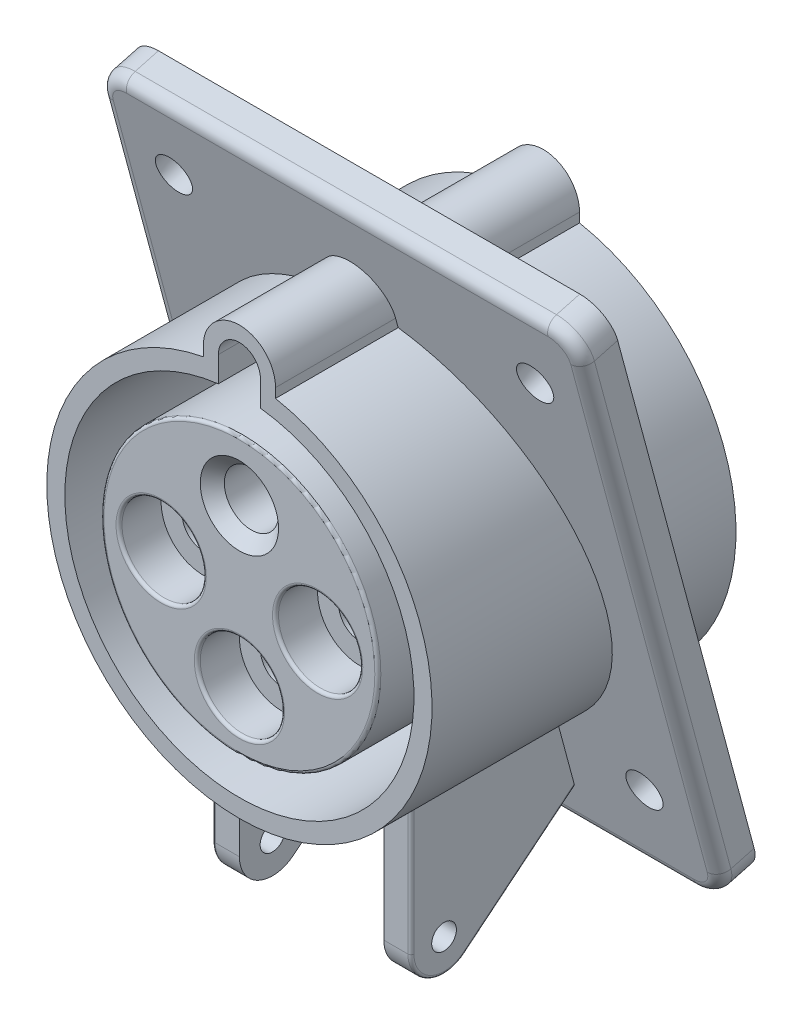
ISO-10303-21;
HEADER;
FILE_DESCRIPTION(('STEP AP214'),'2;1');
FILE_NAME('part.step','',(''),(''),'','','');
FILE_SCHEMA(('AUTOMOTIVE_DESIGN { 1 0 10303 214 1 1 1 1 }'));
ENDSEC;
DATA;
#1=APPLICATION_CONTEXT('core data for automotive mechanical design processes');
#2=APPLICATION_PROTOCOL_DEFINITION('international standard','automotive_design',2000,#1);
#3=PRODUCT_CONTEXT('',#1,'mechanical');
#4=PRODUCT('Part','Part','',(#3));
#5=PRODUCT_RELATED_PRODUCT_CATEGORY('part','',(#4));
#6=PRODUCT_DEFINITION_FORMATION('','',#4);
#7=PRODUCT_DEFINITION_CONTEXT('part definition',#1,'design');
#8=PRODUCT_DEFINITION('design','',#6,#7);
#9=PRODUCT_DEFINITION_SHAPE('','',#8);
#10=(LENGTH_UNIT() NAMED_UNIT(*) SI_UNIT(.MILLI.,.METRE.));
#11=(NAMED_UNIT(*) PLANE_ANGLE_UNIT() SI_UNIT($,.RADIAN.));
#12=(NAMED_UNIT(*) SI_UNIT($,.STERADIAN.) SOLID_ANGLE_UNIT());
#13=UNCERTAINTY_MEASURE_WITH_UNIT(LENGTH_MEASURE(1.E-05),#10,'distance_accuracy_value','');
#14=(GEOMETRIC_REPRESENTATION_CONTEXT(3) GLOBAL_UNCERTAINTY_ASSIGNED_CONTEXT((#13)) GLOBAL_UNIT_ASSIGNED_CONTEXT((#10,
#11,#12)) REPRESENTATION_CONTEXT('',''));
#15=CARTESIAN_POINT('',(0.,0.,0.));
#16=DIRECTION('',(0.,0.,1.));
#17=DIRECTION('',(1.,0.,0.));
#18=AXIS2_PLACEMENT_3D('',#15,#16,#17);
#19=CARTESIAN_POINT('',(0.,0.,52.));
#20=DIRECTION('',(0.,0.,1.));
#21=DIRECTION('',(1.,0.,0.));
#22=AXIS2_PLACEMENT_3D('',#19,#20,#21);
#23=PLANE('',#22);
#24=CARTESIAN_POINT('',(0.,0.,52.));
#25=DIRECTION('',(0.,0.,1.));
#26=DIRECTION('',(1.,0.,0.));
#27=AXIS2_PLACEMENT_3D('',#24,#25,#26);
#28=CIRCLE('',#27,22.5);
#29=CARTESIAN_POINT('',(22.5,0.,52.));
#30=VERTEX_POINT('',#29);
#31=EDGE_CURVE('E11',#30,#30,#28,.T.);
#32=ORIENTED_EDGE('',*,*,#31,.T.);
#33=EDGE_LOOP('',(#32));
#34=FACE_BOUND('',#33,.T.);
#35=CARTESIAN_POINT('',(0.,13.,52.));
#36=DIRECTION('',(0.,0.,1.));
#37=DIRECTION('',(1.,0.,0.));
#38=AXIS2_PLACEMENT_3D('',#35,#36,#37);
#39=CIRCLE('',#38,6.50000000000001);
#40=CARTESIAN_POINT('',(6.50000000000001,13.,52.));
#41=VERTEX_POINT('',#40);
#42=EDGE_CURVE('E55',#41,#41,#39,.F.);
#43=ORIENTED_EDGE('',*,*,#42,.T.);
#44=EDGE_LOOP('',(#43));
#45=FACE_BOUND('',#44,.T.);
#46=CARTESIAN_POINT('',(13.,0.,52.));
#47=DIRECTION('',(0.,0.,1.));
#48=DIRECTION('',(1.,0.,0.));
#49=AXIS2_PLACEMENT_3D('',#46,#47,#48);
#50=CIRCLE('',#49,7.5);
#51=CARTESIAN_POINT('',(20.5,0.,52.));
#52=VERTEX_POINT('',#51);
#53=EDGE_CURVE('E70',#52,#52,#50,.F.);
#54=ORIENTED_EDGE('',*,*,#53,.T.);
#55=EDGE_LOOP('',(#54));
#56=FACE_BOUND('',#55,.T.);
#57=CARTESIAN_POINT('',(-13.,0.,52.));
#58=DIRECTION('',(0.,0.,1.));
#59=DIRECTION('',(1.,0.,0.));
#60=AXIS2_PLACEMENT_3D('',#57,#58,#59);
#61=CIRCLE('',#60,7.5);
#62=CARTESIAN_POINT('',(-5.5,0.,52.));
#63=VERTEX_POINT('',#62);
#64=EDGE_CURVE('E73',#63,#63,#61,.F.);
#65=ORIENTED_EDGE('',*,*,#64,.T.);
#66=EDGE_LOOP('',(#65));
#67=FACE_BOUND('',#66,.T.);
#68=CARTESIAN_POINT('',(0.,-13.,52.));
#69=DIRECTION('',(0.,0.,1.));
#70=DIRECTION('',(1.,0.,0.));
#71=AXIS2_PLACEMENT_3D('',#68,#69,#70);
#72=CIRCLE('',#71,7.5);
#73=CARTESIAN_POINT('',(7.5,-13.,52.));
#74=VERTEX_POINT('',#73);
#75=EDGE_CURVE('E76',#74,#74,#72,.F.);
#76=ORIENTED_EDGE('',*,*,#75,.T.);
#77=EDGE_LOOP('',(#76));
#78=FACE_BOUND('',#77,.T.);
#79=ADVANCED_FACE('F44',(#34,#45,#56,#67,#78),#23,.T.);
#80=CARTESIAN_POINT('',(0.,0.,1.5));
#81=DIRECTION('',(0.,0.,-1.));
#82=DIRECTION('',(-1.,0.,0.));
#83=AXIS2_PLACEMENT_3D('',#80,#81,#82);
#84=PLANE('',#83);
#85=CARTESIAN_POINT('',(0.,0.,1.5));
#86=DIRECTION('',(0.,0.,-1.));
#87=DIRECTION('',(-1.,0.,0.));
#88=AXIS2_PLACEMENT_3D('',#85,#86,#87);
#89=CIRCLE('',#88,23.);
#90=CARTESIAN_POINT('',(-23.,0.,1.5));
#91=VERTEX_POINT('',#90);
#92=EDGE_CURVE('E82',#91,#91,#89,.T.);
#93=ORIENTED_EDGE('',*,*,#92,.T.);
#94=EDGE_LOOP('',(#93));
#95=FACE_BOUND('',#94,.T.);
#96=ADVANCED_FACE('F135',(#95),#84,.T.);
#97=CARTESIAN_POINT('',(0.,0.,117.053823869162));
#98=DIRECTION('',(0.,0.,-1.));
#99=DIRECTION('',(-1.,0.,0.));
#100=AXIS2_PLACEMENT_3D('',#97,#98,#99);
#101=CYLINDRICAL_SURFACE('',#100,23.);
#102=CARTESIAN_POINT('',(0.,0.,51.5));
#103=DIRECTION('',(0.,0.,1.));
#104=DIRECTION('',(1.,0.,0.));
#105=AXIS2_PLACEMENT_3D('',#102,#103,#104);
#106=CIRCLE('',#105,23.);
#107=CARTESIAN_POINT('',(23.,0.,51.5));
#108=VERTEX_POINT('',#107);
#109=EDGE_CURVE('E51',#108,#108,#106,.F.);
#110=ORIENTED_EDGE('',*,*,#109,.T.);
#111=EDGE_LOOP('',(#110));
#112=FACE_BOUND('',#111,.T.);
#113=ORIENTED_EDGE('',*,*,#92,.F.);
#114=EDGE_LOOP('',(#113));
#115=FACE_BOUND('',#114,.T.);
#116=ADVANCED_FACE('F140',(#112,#115),#101,.T.);
#117=CARTESIAN_POINT('',(0.,13.,5.));
#118=DIRECTION('',(0.,0.,1.));
#119=DIRECTION('',(1.,0.,0.));
#120=AXIS2_PLACEMENT_3D('',#117,#118,#119);
#121=CYLINDRICAL_SURFACE('',#120,4.5);
#122=CARTESIAN_POINT('',(0.,13.,50.));
#123=DIRECTION('',(0.,0.,1.));
#124=DIRECTION('',(1.,0.,0.));
#125=AXIS2_PLACEMENT_3D('',#122,#123,#124);
#126=CIRCLE('',#125,4.5);
#127=CARTESIAN_POINT('',(4.5,13.,50.));
#128=VERTEX_POINT('',#127);
#129=EDGE_CURVE('E59',#128,#128,#126,.T.);
#130=ORIENTED_EDGE('',*,*,#129,.T.);
#131=EDGE_LOOP('',(#130));
#132=FACE_BOUND('',#131,.T.);
#133=CARTESIAN_POINT('',(0.,13.,5.));
#134=DIRECTION('',(0.,0.,1.));
#135=DIRECTION('',(1.,0.,0.));
#136=AXIS2_PLACEMENT_3D('',#133,#134,#135);
#137=CIRCLE('',#136,4.5);
#138=CARTESIAN_POINT('',(4.5,13.,5.));
#139=VERTEX_POINT('',#138);
#140=EDGE_CURVE('E96',#139,#139,#137,.T.);
#141=ORIENTED_EDGE('',*,*,#140,.F.);
#142=EDGE_LOOP('',(#141));
#143=FACE_BOUND('',#142,.T.);
#144=ADVANCED_FACE('F169',(#132,#143),#121,.F.);
#145=CARTESIAN_POINT('',(0.,13.,5.));
#146=DIRECTION('',(0.,0.,1.));
#147=DIRECTION('',(1.,0.,0.));
#148=AXIS2_PLACEMENT_3D('',#145,#146,#147);
#149=PLANE('',#148);
#150=ORIENTED_EDGE('',*,*,#140,.T.);
#151=EDGE_LOOP('',(#150));
#152=FACE_BOUND('',#151,.T.);
#153=ADVANCED_FACE('F172',(#152),#149,.T.);
#154=CARTESIAN_POINT('',(13.,0.,45.));
#155=DIRECTION('',(0.,0.,1.));
#156=DIRECTION('',(1.,0.,0.));
#157=AXIS2_PLACEMENT_3D('',#154,#155,#156);
#158=PLANE('',#157);
#159=CARTESIAN_POINT('',(13.,0.,45.));
#160=DIRECTION('',(0.,0.,1.));
#161=DIRECTION('',(1.,0.,0.));
#162=AXIS2_PLACEMENT_3D('',#159,#160,#161);
#163=CIRCLE('',#162,7.);
#164=CARTESIAN_POINT('',(20.,0.,45.));
#165=VERTEX_POINT('',#164);
#166=EDGE_CURVE('E110',#165,#165,#163,.T.);
#167=ORIENTED_EDGE('',*,*,#166,.T.);
#168=EDGE_LOOP('',(#167));
#169=FACE_BOUND('',#168,.T.);
#170=CARTESIAN_POINT('',(13.,0.,45.));
#171=DIRECTION('',(0.,0.,1.));
#172=DIRECTION('',(1.,0.,0.));
#173=AXIS2_PLACEMENT_3D('',#170,#171,#172);
#174=CIRCLE('',#173,3.5);
#175=CARTESIAN_POINT('',(16.5,0.,45.));
#176=VERTEX_POINT('',#175);
#177=EDGE_CURVE('E90',#176,#176,#174,.F.);
#178=ORIENTED_EDGE('',*,*,#177,.T.);
#179=EDGE_LOOP('',(#178));
#180=FACE_BOUND('',#179,.T.);
#181=ADVANCED_FACE('F177',(#169,#180),#158,.T.);
#182=CARTESIAN_POINT('',(13.,0.,45.));
#183=DIRECTION('',(0.,0.,1.));
#184=DIRECTION('',(1.,0.,0.));
#185=AXIS2_PLACEMENT_3D('',#182,#183,#184);
#186=CYLINDRICAL_SURFACE('',#185,7.);
#187=CARTESIAN_POINT('',(13.,0.,51.5));
#188=DIRECTION('',(0.,0.,1.));
#189=DIRECTION('',(1.,0.,0.));
#190=AXIS2_PLACEMENT_3D('',#187,#188,#189);
#191=CIRCLE('',#190,7.);
#192=CARTESIAN_POINT('',(20.,0.,51.5));
#193=VERTEX_POINT('',#192);
#194=EDGE_CURVE('E79',#193,#193,#191,.T.);
#195=ORIENTED_EDGE('',*,*,#194,.T.);
#196=EDGE_LOOP('',(#195));
#197=FACE_BOUND('',#196,.T.);
#198=ORIENTED_EDGE('',*,*,#166,.F.);
#199=EDGE_LOOP('',(#198));
#200=FACE_BOUND('',#199,.T.);
#201=ADVANCED_FACE('F131',(#197,#200),#186,.F.);
#202=CARTESIAN_POINT('',(-13.,0.,45.));
#203=DIRECTION('',(0.,0.,1.));
#204=DIRECTION('',(1.,0.,0.));
#205=AXIS2_PLACEMENT_3D('',#202,#203,#204);
#206=PLANE('',#205);
#207=CARTESIAN_POINT('',(-13.,0.,45.));
#208=DIRECTION('',(0.,0.,1.));
#209=DIRECTION('',(1.,0.,0.));
#210=AXIS2_PLACEMENT_3D('',#207,#208,#209);
#211=CIRCLE('',#210,7.);
#212=CARTESIAN_POINT('',(-6.,0.,45.));
#213=VERTEX_POINT('',#212);
#214=EDGE_CURVE('E109',#213,#213,#211,.T.);
#215=ORIENTED_EDGE('',*,*,#214,.T.);
#216=EDGE_LOOP('',(#215));
#217=FACE_BOUND('',#216,.T.);
#218=CARTESIAN_POINT('',(-13.,0.,45.));
#219=DIRECTION('',(0.,0.,1.));
#220=DIRECTION('',(1.,0.,0.));
#221=AXIS2_PLACEMENT_3D('',#218,#219,#220);
#222=CIRCLE('',#221,3.5);
#223=CARTESIAN_POINT('',(-9.5,0.,45.));
#224=VERTEX_POINT('',#223);
#225=EDGE_CURVE('E87',#224,#224,#222,.F.);
#226=ORIENTED_EDGE('',*,*,#225,.T.);
#227=EDGE_LOOP('',(#226));
#228=FACE_BOUND('',#227,.T.);
#229=ADVANCED_FACE('F116',(#217,#228),#206,.T.);
#230=CARTESIAN_POINT('',(-13.,0.,45.));
#231=DIRECTION('',(0.,0.,1.));
#232=DIRECTION('',(1.,0.,0.));
#233=AXIS2_PLACEMENT_3D('',#230,#231,#232);
#234=CYLINDRICAL_SURFACE('',#233,7.);
#235=CARTESIAN_POINT('',(-13.,0.,51.5));
#236=DIRECTION('',(0.,0.,1.));
#237=DIRECTION('',(1.,0.,0.));
#238=AXIS2_PLACEMENT_3D('',#235,#236,#237);
#239=CIRCLE('',#238,7.);
#240=CARTESIAN_POINT('',(-6.,0.,51.5));
#241=VERTEX_POINT('',#240);
#242=EDGE_CURVE('E67',#241,#241,#239,.T.);
#243=ORIENTED_EDGE('',*,*,#242,.T.);
#244=EDGE_LOOP('',(#243));
#245=FACE_BOUND('',#244,.T.);
#246=ORIENTED_EDGE('',*,*,#214,.F.);
#247=EDGE_LOOP('',(#246));
#248=FACE_BOUND('',#247,.T.);
#249=ADVANCED_FACE('F119',(#245,#248),#234,.F.);
#250=CARTESIAN_POINT('',(0.,-13.,45.));
#251=DIRECTION('',(0.,0.,1.));
#252=DIRECTION('',(1.,0.,0.));
#253=AXIS2_PLACEMENT_3D('',#250,#251,#252);
#254=PLANE('',#253);
#255=CARTESIAN_POINT('',(0.,-13.,45.));
#256=DIRECTION('',(0.,0.,1.));
#257=DIRECTION('',(1.,0.,0.));
#258=AXIS2_PLACEMENT_3D('',#255,#256,#257);
#259=CIRCLE('',#258,7.);
#260=CARTESIAN_POINT('',(7.,-13.,45.));
#261=VERTEX_POINT('',#260);
#262=EDGE_CURVE('E93',#261,#261,#259,.T.);
#263=ORIENTED_EDGE('',*,*,#262,.T.);
#264=EDGE_LOOP('',(#263));
#265=FACE_BOUND('',#264,.T.);
#266=CARTESIAN_POINT('',(0.,-13.,45.));
#267=DIRECTION('',(0.,0.,1.));
#268=DIRECTION('',(1.,0.,0.));
#269=AXIS2_PLACEMENT_3D('',#266,#267,#268);
#270=CIRCLE('',#269,3.5);
#271=CARTESIAN_POINT('',(3.5,-13.,45.));
#272=VERTEX_POINT('',#271);
#273=EDGE_CURVE('E83',#272,#272,#270,.F.);
#274=ORIENTED_EDGE('',*,*,#273,.T.);
#275=EDGE_LOOP('',(#274));
#276=FACE_BOUND('',#275,.T.);
#277=ADVANCED_FACE('F121',(#265,#276),#254,.T.);
#278=CARTESIAN_POINT('',(0.,-13.,45.));
#279=DIRECTION('',(0.,0.,1.));
#280=DIRECTION('',(1.,0.,0.));
#281=AXIS2_PLACEMENT_3D('',#278,#279,#280);
#282=CYLINDRICAL_SURFACE('',#281,7.);
#283=CARTESIAN_POINT('',(0.,-13.,51.5));
#284=DIRECTION('',(0.,0.,1.));
#285=DIRECTION('',(1.,0.,0.));
#286=AXIS2_PLACEMENT_3D('',#283,#284,#285);
#287=CIRCLE('',#286,7.);
#288=CARTESIAN_POINT('',(7.,-13.,51.5));
#289=VERTEX_POINT('',#288);
#290=EDGE_CURVE('E64',#289,#289,#287,.T.);
#291=ORIENTED_EDGE('',*,*,#290,.T.);
#292=EDGE_LOOP('',(#291));
#293=FACE_BOUND('',#292,.T.);
#294=ORIENTED_EDGE('',*,*,#262,.F.);
#295=EDGE_LOOP('',(#294));
#296=FACE_BOUND('',#295,.T.);
#297=ADVANCED_FACE('F128',(#293,#296),#282,.F.);
#298=CARTESIAN_POINT('',(13.,0.,5.));
#299=DIRECTION('',(0.,0.,1.));
#300=DIRECTION('',(1.,0.,0.));
#301=AXIS2_PLACEMENT_3D('',#298,#299,#300);
#302=PLANE('',#301);
#303=CARTESIAN_POINT('',(13.,0.,5.));
#304=DIRECTION('',(0.,0.,1.));
#305=DIRECTION('',(1.,0.,0.));
#306=AXIS2_PLACEMENT_3D('',#303,#304,#305);
#307=CIRCLE('',#306,3.5);
#308=CARTESIAN_POINT('',(16.5,0.,5.));
#309=VERTEX_POINT('',#308);
#310=EDGE_CURVE('E102',#309,#309,#307,.T.);
#311=ORIENTED_EDGE('',*,*,#310,.T.);
#312=EDGE_LOOP('',(#311));
#313=FACE_BOUND('',#312,.T.);
#314=ADVANCED_FACE('F185',(#313),#302,.T.);
#315=CARTESIAN_POINT('',(13.,0.,5.));
#316=DIRECTION('',(0.,0.,1.));
#317=DIRECTION('',(1.,0.,0.));
#318=AXIS2_PLACEMENT_3D('',#315,#316,#317);
#319=CYLINDRICAL_SURFACE('',#318,3.5);
#320=ORIENTED_EDGE('',*,*,#310,.F.);
#321=EDGE_LOOP('',(#320));
#322=FACE_BOUND('',#321,.T.);
#323=ORIENTED_EDGE('',*,*,#177,.F.);
#324=EDGE_LOOP('',(#323));
#325=FACE_BOUND('',#324,.T.);
#326=ADVANCED_FACE('F188',(#322,#325),#319,.F.);
#327=CARTESIAN_POINT('',(-13.,0.,5.));
#328=DIRECTION('',(0.,0.,1.));
#329=DIRECTION('',(1.,0.,0.));
#330=AXIS2_PLACEMENT_3D('',#327,#328,#329);
#331=PLANE('',#330);
#332=CARTESIAN_POINT('',(-13.,0.,5.));
#333=DIRECTION('',(0.,0.,1.));
#334=DIRECTION('',(1.,0.,0.));
#335=AXIS2_PLACEMENT_3D('',#332,#333,#334);
#336=CIRCLE('',#335,3.5);
#337=CARTESIAN_POINT('',(-9.5,0.,5.));
#338=VERTEX_POINT('',#337);
#339=EDGE_CURVE('E99',#338,#338,#336,.T.);
#340=ORIENTED_EDGE('',*,*,#339,.T.);
#341=EDGE_LOOP('',(#340));
#342=FACE_BOUND('',#341,.T.);
#343=ADVANCED_FACE('F192',(#342),#331,.T.);
#344=CARTESIAN_POINT('',(-13.,0.,5.));
#345=DIRECTION('',(0.,0.,1.));
#346=DIRECTION('',(1.,0.,0.));
#347=AXIS2_PLACEMENT_3D('',#344,#345,#346);
#348=CYLINDRICAL_SURFACE('',#347,3.5);
#349=ORIENTED_EDGE('',*,*,#339,.F.);
#350=EDGE_LOOP('',(#349));
#351=FACE_BOUND('',#350,.T.);
#352=ORIENTED_EDGE('',*,*,#225,.F.);
#353=EDGE_LOOP('',(#352));
#354=FACE_BOUND('',#353,.T.);
#355=ADVANCED_FACE('F196',(#351,#354),#348,.F.);
#356=CARTESIAN_POINT('',(0.,-13.,5.));
#357=DIRECTION('',(0.,0.,1.));
#358=DIRECTION('',(1.,0.,0.));
#359=AXIS2_PLACEMENT_3D('',#356,#357,#358);
#360=PLANE('',#359);
#361=CARTESIAN_POINT('',(0.,-13.,5.));
#362=DIRECTION('',(0.,0.,1.));
#363=DIRECTION('',(1.,0.,0.));
#364=AXIS2_PLACEMENT_3D('',#361,#362,#363);
#365=CIRCLE('',#364,3.5);
#366=CARTESIAN_POINT('',(3.5,-13.,5.));
#367=VERTEX_POINT('',#366);
#368=EDGE_CURVE('E86',#367,#367,#365,.T.);
#369=ORIENTED_EDGE('',*,*,#368,.T.);
#370=EDGE_LOOP('',(#369));
#371=FACE_BOUND('',#370,.T.);
#372=ADVANCED_FACE('F200',(#371),#360,.T.);
#373=CARTESIAN_POINT('',(0.,-13.,5.));
#374=DIRECTION('',(0.,0.,1.));
#375=DIRECTION('',(1.,0.,0.));
#376=AXIS2_PLACEMENT_3D('',#373,#374,#375);
#377=CYLINDRICAL_SURFACE('',#376,3.5);
#378=ORIENTED_EDGE('',*,*,#368,.F.);
#379=EDGE_LOOP('',(#378));
#380=FACE_BOUND('',#379,.T.);
#381=ORIENTED_EDGE('',*,*,#273,.F.);
#382=EDGE_LOOP('',(#381));
#383=FACE_BOUND('',#382,.T.);
#384=ADVANCED_FACE('F150',(#380,#383),#377,.F.);
#385=CARTESIAN_POINT('',(13.,0.,51.5));
#386=DIRECTION('',(0.,0.,1.));
#387=DIRECTION('',(1.,0.,0.));
#388=AXIS2_PLACEMENT_3D('',#385,#386,#387);
#389=TOROIDAL_SURFACE('',#388,7.5,0.5);
#390=ORIENTED_EDGE('',*,*,#53,.F.);
#391=EDGE_LOOP('',(#390));
#392=FACE_BOUND('',#391,.T.);
#393=ORIENTED_EDGE('',*,*,#194,.F.);
#394=EDGE_LOOP('',(#393));
#395=FACE_BOUND('',#394,.T.);
#396=ADVANCED_FACE('F146',(#392,#395),#389,.T.);
#397=CARTESIAN_POINT('',(-13.,0.,51.5));
#398=DIRECTION('',(0.,0.,1.));
#399=DIRECTION('',(1.,0.,0.));
#400=AXIS2_PLACEMENT_3D('',#397,#398,#399);
#401=TOROIDAL_SURFACE('',#400,7.5,0.5);
#402=ORIENTED_EDGE('',*,*,#64,.F.);
#403=EDGE_LOOP('',(#402));
#404=FACE_BOUND('',#403,.T.);
#405=ORIENTED_EDGE('',*,*,#242,.F.);
#406=EDGE_LOOP('',(#405));
#407=FACE_BOUND('',#406,.T.);
#408=ADVANCED_FACE('F149',(#404,#407),#401,.T.);
#409=CARTESIAN_POINT('',(0.,-13.,51.5));
#410=DIRECTION('',(0.,0.,1.));
#411=DIRECTION('',(1.,0.,0.));
#412=AXIS2_PLACEMENT_3D('',#409,#410,#411);
#413=TOROIDAL_SURFACE('',#412,7.5,0.5);
#414=ORIENTED_EDGE('',*,*,#75,.F.);
#415=EDGE_LOOP('',(#414));
#416=FACE_BOUND('',#415,.T.);
#417=ORIENTED_EDGE('',*,*,#290,.F.);
#418=EDGE_LOOP('',(#417));
#419=FACE_BOUND('',#418,.T.);
#420=ADVANCED_FACE('F154',(#416,#419),#413,.T.);
#421=CARTESIAN_POINT('',(0.,13.,50.));
#422=DIRECTION('',(0.,0.,1.));
#423=DIRECTION('',(1.,0.,0.));
#424=AXIS2_PLACEMENT_3D('',#421,#422,#423);
#425=CONICAL_SURFACE('',#424,4.5,0.785398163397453);
#426=ORIENTED_EDGE('',*,*,#42,.F.);
#427=EDGE_LOOP('',(#426));
#428=FACE_BOUND('',#427,.T.);
#429=ORIENTED_EDGE('',*,*,#129,.F.);
#430=EDGE_LOOP('',(#429));
#431=FACE_BOUND('',#430,.T.);
#432=ADVANCED_FACE('F157',(#428,#431),#425,.F.);
#433=CARTESIAN_POINT('',(0.,0.,51.5));
#434=DIRECTION('',(0.,0.,1.));
#435=DIRECTION('',(1.,0.,0.));
#436=AXIS2_PLACEMENT_3D('',#433,#434,#435);
#437=TOROIDAL_SURFACE('',#436,22.5,0.5);
#438=ORIENTED_EDGE('',*,*,#31,.F.);
#439=EDGE_LOOP('',(#438));
#440=FACE_BOUND('',#439,.T.);
#441=ORIENTED_EDGE('',*,*,#109,.F.);
#442=EDGE_LOOP('',(#441));
#443=FACE_BOUND('',#442,.T.);
#444=ADVANCED_FACE('F46',(#440,#443),#437,.T.);
#445=CLOSED_SHELL('',(#79,#96,#116,#144,#153,#181,#201,#229,#249,#277,#297,#314,#326,#343,#355,
#372,#384,#396,#408,#420,#432,#444));
#446=MANIFOLD_SOLID_BREP('B2',#445);
#447=CARTESIAN_POINT('',(-16.5,-49.5,40.0000321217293));
#448=DIRECTION('',(0.,0.,1.));
#449=DIRECTION('',(1.,0.,0.));
#450=AXIS2_PLACEMENT_3D('',#447,#448,#449);
#451=PLANE('',#450);
#452=CARTESIAN_POINT('',(0.,0.,40.0000321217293));
#453=DIRECTION('',(0.,0.,1.));
#454=DIRECTION('',(1.,0.,0.));
#455=AXIS2_PLACEMENT_3D('',#452,#453,#454);
#456=CIRCLE('',#455,32.);
#457=CARTESIAN_POINT('',(-16.,-27.712812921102,40.0000321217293));
#458=VERTEX_POINT('',#457);
#459=CARTESIAN_POINT('',(-12.,-29.6647939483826,40.0000321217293));
#460=VERTEX_POINT('',#459);
#461=EDGE_CURVE('E682',#458,#460,#456,.T.);
#462=ORIENTED_EDGE('',*,*,#461,.F.);
#463=DIRECTION('',(0.,-1.,0.));
#464=VECTOR('',#463,1.);
#465=CARTESIAN_POINT('',(-16.,-49.5,40.0000321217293));
#466=LINE('',#465,#464);
#467=CARTESIAN_POINT('',(-16.,-49.5,40.0000321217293));
#468=VERTEX_POINT('',#467);
#469=EDGE_CURVE('E940',#458,#468,#466,.T.);
#470=ORIENTED_EDGE('',*,*,#469,.T.);
#471=DIRECTION('',(1.,0.,0.));
#472=VECTOR('',#471,1.);
#473=CARTESIAN_POINT('',(-16.5,-49.5,40.0000321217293));
#474=LINE('',#473,#472);
#475=CARTESIAN_POINT('',(-12.,-49.5,40.0000321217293));
#476=VERTEX_POINT('',#475);
#477=EDGE_CURVE('E673',#468,#476,#474,.T.);
#478=ORIENTED_EDGE('',*,*,#477,.T.);
#479=DIRECTION('',(0.,-1.,0.));
#480=VECTOR('',#479,1.);
#481=CARTESIAN_POINT('',(-12.,-60.3890192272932,40.0000321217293));
#482=LINE('',#481,#480);
#483=EDGE_CURVE('E644',#460,#476,#482,.T.);
#484=ORIENTED_EDGE('',*,*,#483,.F.);
#485=EDGE_LOOP('',(#462,#470,#478,#484));
#486=FACE_BOUND('',#485,.T.);
#487=ADVANCED_FACE('F370',(#486),#451,.T.);
#488=CARTESIAN_POINT('',(-16.5,-49.5,34.5));
#489=DIRECTION('',(1.,0.,0.));
#490=DIRECTION('',(0.,0.,-1.));
#491=AXIS2_PLACEMENT_3D('',#488,#489,#490);
#492=CYLINDRICAL_SURFACE('',#491,5.5000321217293);
#493=ORIENTED_EDGE('',*,*,#477,.F.);
#494=CARTESIAN_POINT('',(-16.,-49.5,34.5));
#495=DIRECTION('',(1.,0.,0.));
#496=DIRECTION('',(0.,0.,-1.));
#497=AXIS2_PLACEMENT_3D('',#494,#495,#496);
#498=CIRCLE('',#497,5.5000321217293);
#499=CARTESIAN_POINT('',(-16.,-53.763749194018,31.0256948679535));
#500=VERTEX_POINT('',#499);
#501=EDGE_CURVE('E929',#468,#500,#498,.T.);
#502=ORIENTED_EDGE('',*,*,#501,.T.);
#503=DIRECTION('',(1.,0.,0.));
#504=VECTOR('',#503,1.);
#505=CARTESIAN_POINT('',(-16.5,-53.763749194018,31.0256948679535));
#506=LINE('',#505,#504);
#507=CARTESIAN_POINT('',(-12.,-53.763749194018,31.0256948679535));
#508=VERTEX_POINT('',#507);
#509=EDGE_CURVE('E680',#500,#508,#506,.T.);
#510=ORIENTED_EDGE('',*,*,#509,.T.);
#511=CARTESIAN_POINT('',(-12.,-49.5,34.5));
#512=DIRECTION('',(-1.,0.,0.));
#513=DIRECTION('',(0.,0.,1.));
#514=AXIS2_PLACEMENT_3D('',#511,#512,#513);
#515=CIRCLE('',#514,5.5000321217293);
#516=EDGE_CURVE('E659',#476,#508,#515,.F.);
#517=ORIENTED_EDGE('',*,*,#516,.F.);
#518=EDGE_LOOP('',(#493,#502,#510,#517));
#519=FACE_BOUND('',#518,.T.);
#520=ADVANCED_FACE('F980',(#519),#492,.T.);
#521=CARTESIAN_POINT('',(-16.5,-49.5,34.5));
#522=DIRECTION('',(1.,0.,0.));
#523=DIRECTION('',(0.,0.,-1.));
#524=AXIS2_PLACEMENT_3D('',#521,#522,#523);
#525=CYLINDRICAL_SURFACE('',#524,2.05474005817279);
#526=CARTESIAN_POINT('',(-12.,-49.5,34.5));
#527=DIRECTION('',(-1.,0.,0.));
#528=DIRECTION('',(0.,0.,1.));
#529=AXIS2_PLACEMENT_3D('',#526,#527,#528);
#530=CIRCLE('',#529,2.05474005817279);
#531=CARTESIAN_POINT('',(-12.,-49.5,36.5547400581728));
#532=VERTEX_POINT('',#531);
#533=EDGE_CURVE('E655',#532,#532,#530,.F.);
#534=ORIENTED_EDGE('',*,*,#533,.T.);
#535=EDGE_LOOP('',(#534));
#536=FACE_BOUND('',#535,.T.);
#537=CARTESIAN_POINT('',(-16.5,-49.5,34.5));
#538=DIRECTION('',(1.,0.,0.));
#539=DIRECTION('',(0.,0.,-1.));
#540=AXIS2_PLACEMENT_3D('',#537,#538,#539);
#541=CIRCLE('',#540,2.05474005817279);
#542=CARTESIAN_POINT('',(-16.5,-49.5,32.4452599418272));
#543=VERTEX_POINT('',#542);
#544=EDGE_CURVE('E667',#543,#543,#541,.T.);
#545=ORIENTED_EDGE('',*,*,#544,.F.);
#546=EDGE_LOOP('',(#545));
#547=FACE_BOUND('',#546,.T.);
#548=ADVANCED_FACE('F988',(#536,#547),#525,.F.);
#549=CARTESIAN_POINT('',(-40.,48.6282917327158,36.2467455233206));
#550=DIRECTION('',(0.,-0.259410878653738,0.96576705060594));
#551=DIRECTION('',(0.,-0.96576705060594,-0.259410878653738));
#552=AXIS2_PLACEMENT_3D('',#549,#550,#551);
#553=PLANE('',#552);
#554=CARTESIAN_POINT('',(30.,-31.5450880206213,14.7116901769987));
#555=DIRECTION('',(0.,-0.259410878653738,0.96576705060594));
#556=DIRECTION('',(0.,-0.96576705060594,-0.259410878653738));
#557=AXIS2_PLACEMENT_3D('',#554,#555,#556);
#558=CIRCLE('',#557,2.99999999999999);
#559=CARTESIAN_POINT('',(30.,-34.4423891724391,13.9334575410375));
#560=VERTEX_POINT('',#559);
#561=EDGE_CURVE('E684',#560,#560,#558,.T.);
#562=ORIENTED_EDGE('',*,*,#561,.F.);
#563=EDGE_LOOP('',(#562));
#564=FACE_BOUND('',#563,.T.);
#565=CARTESIAN_POINT('',(-30.,-31.5450880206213,14.7116901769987));
#566=DIRECTION('',(0.,-0.259410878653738,0.96576705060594));
#567=DIRECTION('',(0.,-0.96576705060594,-0.259410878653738));
#568=AXIS2_PLACEMENT_3D('',#565,#566,#567);
#569=CIRCLE('',#568,2.99999999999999);
#570=CARTESIAN_POINT('',(-30.,-34.4423891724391,13.9334575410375));
#571=VERTEX_POINT('',#570);
#572=EDGE_CURVE('E689',#571,#571,#569,.T.);
#573=ORIENTED_EDGE('',*,*,#572,.F.);
#574=EDGE_LOOP('',(#573));
#575=FACE_BOUND('',#574,.T.);
#576=CARTESIAN_POINT('',(-30.,36.0586055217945,32.8704516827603));
#577=DIRECTION('',(0.,-0.259410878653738,0.96576705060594));
#578=DIRECTION('',(0.,-0.96576705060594,-0.259410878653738));
#579=AXIS2_PLACEMENT_3D('',#576,#577,#578);
#580=CIRCLE('',#579,3.);
#581=CARTESIAN_POINT('',(-30.,33.1613043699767,32.0922190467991));
#582=VERTEX_POINT('',#581);
#583=EDGE_CURVE('E685',#582,#582,#580,.T.);
#584=ORIENTED_EDGE('',*,*,#583,.F.);
#585=EDGE_LOOP('',(#584));
#586=FACE_BOUND('',#585,.T.);
#587=CARTESIAN_POINT('',(30.,36.0586055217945,32.8704516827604));
#588=DIRECTION('',(0.,-0.259410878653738,0.96576705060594));
#589=DIRECTION('',(0.,-0.96576705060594,-0.259410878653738));
#590=AXIS2_PLACEMENT_3D('',#587,#588,#589);
#591=CIRCLE('',#590,2.99999999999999);
#592=CARTESIAN_POINT('',(30.,33.1613043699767,32.0922190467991));
#593=VERTEX_POINT('',#592);
#594=EDGE_CURVE('E688',#593,#593,#591,.T.);
#595=ORIENTED_EDGE('',*,*,#594,.F.);
#596=EDGE_LOOP('',(#595));
#597=FACE_BOUND('',#596,.T.);
#598=DIRECTION('',(1.,0.,0.));
#599=VECTOR('',#598,1.);
#600=CARTESIAN_POINT('',(-40.,46.6967576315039,35.7279237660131));
#601=LINE('',#600,#599);
#602=CARTESIAN_POINT('',(35.,46.6967576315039,35.7279237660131));
#603=VERTEX_POINT('',#602);
#604=CARTESIAN_POINT('',(-35.,46.6967576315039,35.7279237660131));
#605=VERTEX_POINT('',#604);
#606=EDGE_CURVE('E865',#603,#605,#601,.F.);
#607=ORIENTED_EDGE('',*,*,#606,.T.);
#608=CARTESIAN_POINT('',(-35.,43.7994564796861,34.9496911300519));
#609=DIRECTION('',(0.,-0.259410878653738,0.96576705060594));
#610=DIRECTION('',(0.,-0.96576705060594,-0.259410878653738));
#611=AXIS2_PLACEMENT_3D('',#608,#609,#610);
#612=CIRCLE('',#611,3.);
#613=CARTESIAN_POINT('',(-38.,43.7994564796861,34.9496911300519));
#614=VERTEX_POINT('',#613);
#615=EDGE_CURVE('E867',#605,#614,#612,.T.);
#616=ORIENTED_EDGE('',*,*,#615,.T.);
#617=DIRECTION('',(0.,-0.96576705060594,-0.259410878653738));
#618=VECTOR('',#617,1.);
#619=CARTESIAN_POINT('',(-38.,-40.5874614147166,12.2828539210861));
#620=LINE('',#619,#618);
#621=CARTESIAN_POINT('',(-38.,-40.5874614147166,12.2828539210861));
#622=VERTEX_POINT('',#621);
#623=EDGE_CURVE('E853',#614,#622,#620,.T.);
#624=ORIENTED_EDGE('',*,*,#623,.T.);
#625=CARTESIAN_POINT('',(-35.,-40.5874614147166,12.2828539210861));
#626=DIRECTION('',(0.,-0.259410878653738,0.96576705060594));
#627=DIRECTION('',(0.,-0.96576705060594,-0.259410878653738));
#628=AXIS2_PLACEMENT_3D('',#625,#626,#627);
#629=CIRCLE('',#628,3.);
#630=CARTESIAN_POINT('',(-35.,-43.4847625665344,11.5046212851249));
#631=VERTEX_POINT('',#630);
#632=EDGE_CURVE('E855',#622,#631,#629,.T.);
#633=ORIENTED_EDGE('',*,*,#632,.T.);
#634=DIRECTION('',(1.,0.,0.));
#635=VECTOR('',#634,1.);
#636=CARTESIAN_POINT('',(-40.,-43.4847625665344,11.5046212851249));
#637=LINE('',#636,#635);
#638=CARTESIAN_POINT('',(35.,-43.4847625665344,11.5046212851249));
#639=VERTEX_POINT('',#638);
#640=EDGE_CURVE('E857',#631,#639,#637,.T.);
#641=ORIENTED_EDGE('',*,*,#640,.T.);
#642=CARTESIAN_POINT('',(35.,-40.5874614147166,12.2828539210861));
#643=DIRECTION('',(0.,-0.259410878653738,0.96576705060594));
#644=DIRECTION('',(0.,-0.96576705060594,-0.259410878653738));
#645=AXIS2_PLACEMENT_3D('',#642,#643,#644);
#646=CIRCLE('',#645,3.);
#647=CARTESIAN_POINT('',(38.,-40.5874614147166,12.2828539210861));
#648=VERTEX_POINT('',#647);
#649=EDGE_CURVE('E859',#639,#648,#646,.T.);
#650=ORIENTED_EDGE('',*,*,#649,.T.);
#651=DIRECTION('',(0.,-0.96576705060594,-0.259410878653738));
#652=VECTOR('',#651,1.);
#653=CARTESIAN_POINT('',(38.,48.6282917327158,36.2467455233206));
#654=LINE('',#653,#652);
#655=CARTESIAN_POINT('',(38.,43.7994564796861,34.9496911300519));
#656=VERTEX_POINT('',#655);
#657=EDGE_CURVE('E861',#648,#656,#654,.F.);
#658=ORIENTED_EDGE('',*,*,#657,.T.);
#659=CARTESIAN_POINT('',(35.,43.7994564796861,34.9496911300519));
#660=DIRECTION('',(0.,-0.259410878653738,0.96576705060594));
#661=DIRECTION('',(0.,-0.96576705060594,-0.259410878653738));
#662=AXIS2_PLACEMENT_3D('',#659,#660,#661);
#663=CIRCLE('',#662,3.);
#664=EDGE_CURVE('E863',#656,#603,#663,.T.);
#665=ORIENTED_EDGE('',*,*,#664,.T.);
#666=EDGE_LOOP('',(#607,#616,#624,#633,#641,#650,#658,#665));
#667=FACE_BOUND('',#666,.T.);
#668=DIRECTION('',(1.,0.,0.));
#669=VECTOR('',#668,1.);
#670=CARTESIAN_POINT('',(-16.5,-38.8676199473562,12.744813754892));
#671=LINE('',#670,#669);
#672=CARTESIAN_POINT('',(-16.,-38.8676199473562,12.744813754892));
#673=VERTEX_POINT('',#672);
#674=CARTESIAN_POINT('',(16.,-38.8676199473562,12.744813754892));
#675=VERTEX_POINT('',#674);
#676=EDGE_CURVE('E677',#673,#675,#671,.T.);
#677=ORIENTED_EDGE('',*,*,#676,.F.);
#678=CARTESIAN_POINT('',(-16.,-38.3384622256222,12.8869487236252));
#679=DIRECTION('',(0.,-0.259410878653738,0.96576705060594));
#680=DIRECTION('',(0.,-0.96576705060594,-0.259410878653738));
#681=AXIS2_PLACEMENT_3D('',#678,#679,#680);
#682=ELLIPSE('',#681,0.547914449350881,0.5);
#683=CARTESIAN_POINT('',(-16.5,-38.3384622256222,12.8869487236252));
#684=VERTEX_POINT('',#683);
#685=EDGE_CURVE('E943',#673,#684,#682,.F.);
#686=ORIENTED_EDGE('',*,*,#685,.T.);
#687=DIRECTION('',(0.,0.96576705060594,0.259410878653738));
#688=VECTOR('',#687,1.);
#689=CARTESIAN_POINT('',(-16.5,-25.2432851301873,16.4043925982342));
#690=LINE('',#689,#688);
#691=CARTESIAN_POINT('',(-16.5,-27.4180597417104,15.8202349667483));
#692=VERTEX_POINT('',#691);
#693=EDGE_CURVE('E670',#684,#692,#690,.T.);
#694=ORIENTED_EDGE('',*,*,#693,.T.);
#695=CARTESIAN_POINT('',(0.,0.,23.1848918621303));
#696=DIRECTION('',(0.,-0.259410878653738,0.96576705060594));
#697=DIRECTION('',(0.,-0.96576705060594,-0.259410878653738));
#698=AXIS2_PLACEMENT_3D('',#695,#696,#697);
#699=ELLIPSE('',#698,33.1342842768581,32.);
#700=CARTESIAN_POINT('',(-6.,31.4324672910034,31.627842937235));
#701=VERTEX_POINT('',#700);
#702=EDGE_CURVE('E732',#701,#692,#699,.T.);
#703=ORIENTED_EDGE('',*,*,#702,.F.);
#704=DIRECTION('',(0.,0.96576705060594,0.259410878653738));
#705=VECTOR('',#704,1.);
#706=CARTESIAN_POINT('',(-6.,21.6680081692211,29.0050500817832));
#707=LINE('',#706,#705);
#708=CARTESIAN_POINT('',(-6.,33.,32.0488917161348));
#709=VERTEX_POINT('',#708);
#710=EDGE_CURVE('E728',#701,#709,#707,.T.);
#711=ORIENTED_EDGE('',*,*,#710,.T.);
#712=CARTESIAN_POINT('',(0.,33.,32.0488917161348));
#713=DIRECTION('',(0.,-0.259410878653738,0.96576705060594));
#714=DIRECTION('',(0.,0.96576705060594,0.259410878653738));
#715=AXIS2_PLACEMENT_3D('',#712,#713,#714);
#716=ELLIPSE('',#715,6.21267830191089,6.);
#717=CARTESIAN_POINT('',(6.,33.,32.0488917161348));
#718=VERTEX_POINT('',#717);
#719=EDGE_CURVE('E720',#709,#718,#716,.F.);
#720=ORIENTED_EDGE('',*,*,#719,.T.);
#721=DIRECTION('',(0.,-0.96576705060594,-0.259410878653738));
#722=VECTOR('',#721,1.);
#723=CARTESIAN_POINT('',(6.,19.3723530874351,28.3884232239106));
#724=LINE('',#723,#722);
#725=CARTESIAN_POINT('',(6.,31.4324672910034,31.627842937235));
#726=VERTEX_POINT('',#725);
#727=EDGE_CURVE('E725',#718,#726,#724,.T.);
#728=ORIENTED_EDGE('',*,*,#727,.T.);
#729=CARTESIAN_POINT('',(16.5,-27.4180597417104,15.8202349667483));
#730=VERTEX_POINT('',#729);
#731=EDGE_CURVE('E731',#730,#726,#699,.T.);
#732=ORIENTED_EDGE('',*,*,#731,.F.);
#733=DIRECTION('',(0.,0.96576705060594,0.259410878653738));
#734=VECTOR('',#733,1.);
#735=CARTESIAN_POINT('',(16.5,-25.2432851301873,16.4043925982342));
#736=LINE('',#735,#734);
#737=CARTESIAN_POINT('',(16.5,-38.3384622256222,12.8869487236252));
#738=VERTEX_POINT('',#737);
#739=EDGE_CURVE('E665',#738,#730,#736,.T.);
#740=ORIENTED_EDGE('',*,*,#739,.F.);
#741=CARTESIAN_POINT('',(16.,-38.3384622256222,12.8869487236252));
#742=DIRECTION('',(0.,-0.259410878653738,0.96576705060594));
#743=DIRECTION('',(0.,0.96576705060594,0.259410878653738));
#744=AXIS2_PLACEMENT_3D('',#741,#742,#743);
#745=ELLIPSE('',#744,0.547914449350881,0.5);
#746=EDGE_CURVE('E945',#738,#675,#745,.F.);
#747=ORIENTED_EDGE('',*,*,#746,.T.);
#748=EDGE_LOOP('',(#677,#686,#694,#703,#711,#720,#728,#732,#740,#747));
#749=FACE_BOUND('',#748,.T.);
#750=ADVANCED_FACE('F1034',(#564,#575,#586,#597,#667,#749),#553,.T.);
#751=CARTESIAN_POINT('',(0.,0.,52.));
#752=DIRECTION('',(0.,0.,-1.));
#753=DIRECTION('',(-1.,0.,0.));
#754=AXIS2_PLACEMENT_3D('',#751,#752,#753);
#755=CYLINDRICAL_SURFACE('',#754,32.);
#756=DIRECTION('',(0.,0.,-1.));
#757=VECTOR('',#756,1.);
#758=CARTESIAN_POINT('',(-16.5,-27.4180597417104,52.));
#759=LINE('',#758,#757);
#760=CARTESIAN_POINT('',(-16.5,-27.4180597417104,39.5000321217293));
#761=VERTEX_POINT('',#760);
#762=EDGE_CURVE('E910',#761,#692,#759,.T.);
#763=ORIENTED_EDGE('',*,*,#762,.F.);
#764=CARTESIAN_POINT('',(-16.5,-27.4180597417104,39.5000321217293));
#765=CARTESIAN_POINT('',(-16.5000335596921,-27.4180385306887,39.525325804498));
#766=CARTESIAN_POINT('',(-16.4980831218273,-27.4192133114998,39.5505884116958));
#767=CARTESIAN_POINT('',(-16.4904881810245,-27.4237822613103,39.6002301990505));
#768=CARTESIAN_POINT('',(-16.4848608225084,-27.427166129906,39.6246129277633));
#769=CARTESIAN_POINT('',(-16.4701887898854,-27.4359791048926,39.671897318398));
#770=CARTESIAN_POINT('',(-16.4611475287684,-27.4414061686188,39.6948004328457));
#771=CARTESIAN_POINT('',(-16.440057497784,-27.4540463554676,39.7386568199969));
#772=CARTESIAN_POINT('',(-16.4280059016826,-27.4612611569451,39.7596082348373));
#773=CARTESIAN_POINT('',(-16.4006053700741,-27.4776347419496,39.8002820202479));
#774=CARTESIAN_POINT('',(-16.3851099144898,-27.486879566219,39.8198704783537));
#775=CARTESIAN_POINT('',(-16.3518053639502,-27.5067053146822,39.856178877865));
#776=CARTESIAN_POINT('',(-16.3339957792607,-27.5172865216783,39.8728982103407));
#777=CARTESIAN_POINT('',(-16.2939952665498,-27.5409935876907,39.9053934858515));
#778=CARTESIAN_POINT('',(-16.271537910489,-27.5542697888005,39.920731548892));
#779=CARTESIAN_POINT('',(-16.224878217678,-27.5817705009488,39.9474173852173));
#780=CARTESIAN_POINT('',(-16.2006738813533,-27.5959960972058,39.9587604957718));
#781=CARTESIAN_POINT('',(-16.1475682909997,-27.6271081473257,39.9787158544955));
#782=CARTESIAN_POINT('',(-16.1184882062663,-27.6440855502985,39.9867113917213));
#783=CARTESIAN_POINT('',(-16.0596079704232,-27.6783341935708,39.9973659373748));
#784=CARTESIAN_POINT('',(-16.02980930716,-27.6956048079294,40.0000351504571));
#785=CARTESIAN_POINT('',(-16.,-27.712812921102,40.0000321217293));
#786=B_SPLINE_CURVE_WITH_KNOTS('',3,(#764,#765,#766,#767,#768,#769,#770,#771,#772,#773,#774,
#775,#776,#777,#778,#779,#780,#781,#782,#783,#784,#785),.UNSPECIFIED.,.F.,.F.,(4,2,2,2,2,2,2,2,
2,2,4),(0.,0.0757298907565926,0.151109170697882,0.226413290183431,0.30178837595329,
0.381371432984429,0.460971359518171,0.551401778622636,0.641937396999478,0.745332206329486,
0.848528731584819),.UNSPECIFIED.);
#787=EDGE_CURVE('E380',#761,#458,#786,.T.);
#788=ORIENTED_EDGE('',*,*,#787,.T.);
#789=ORIENTED_EDGE('',*,*,#461,.T.);
#790=DIRECTION('',(0.,0.,1.));
#791=VECTOR('',#790,1.);
#792=CARTESIAN_POINT('',(-12.,-29.6647939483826,20.5000321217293));
#793=LINE('',#792,#791);
#794=CARTESIAN_POINT('',(-12.,-29.6647939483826,20.5000321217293));
#795=VERTEX_POINT('',#794);
#796=EDGE_CURVE('E636',#795,#460,#793,.T.);
#797=ORIENTED_EDGE('',*,*,#796,.F.);
#798=CARTESIAN_POINT('',(0.,0.,20.5000321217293));
#799=DIRECTION('',(0.,0.,-1.));
#800=DIRECTION('',(1.,0.,0.));
#801=AXIS2_PLACEMENT_3D('',#798,#799,#800);
#802=CIRCLE('',#801,32.);
#803=CARTESIAN_POINT('',(12.,-29.6647939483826,20.5000321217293));
#804=VERTEX_POINT('',#803);
#805=EDGE_CURVE('E623',#804,#795,#802,.T.);
#806=ORIENTED_EDGE('',*,*,#805,.F.);
#807=DIRECTION('',(0.,0.,1.));
#808=VECTOR('',#807,1.);
#809=CARTESIAN_POINT('',(12.,-29.6647939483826,20.5000321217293));
#810=LINE('',#809,#808);
#811=CARTESIAN_POINT('',(12.,-29.6647939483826,40.0000321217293));
#812=VERTEX_POINT('',#811);
#813=EDGE_CURVE('E631',#804,#812,#810,.T.);
#814=ORIENTED_EDGE('',*,*,#813,.T.);
#815=CARTESIAN_POINT('',(16.,-27.712812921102,40.0000321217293));
#816=VERTEX_POINT('',#815);
#817=EDGE_CURVE('E675',#812,#816,#456,.T.);
#818=ORIENTED_EDGE('',*,*,#817,.T.);
#819=CARTESIAN_POINT('',(16.,-27.712812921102,40.0000321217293));
#820=CARTESIAN_POINT('',(16.0368628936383,-27.6915355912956,40.0000430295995));
#821=CARTESIAN_POINT('',(16.0737328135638,-27.6701453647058,39.9959539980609));
#822=CARTESIAN_POINT('',(16.1462407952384,-27.6278952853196,39.9796160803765));
#823=CARTESIAN_POINT('',(16.1818699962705,-27.6070394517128,39.9673176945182));
#824=CARTESIAN_POINT('',(16.2455347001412,-27.5696172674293,39.9368213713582));
#825=CARTESIAN_POINT('',(16.2739447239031,-27.5528527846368,39.9196498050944));
#826=CARTESIAN_POINT('',(16.3273605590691,-27.5212327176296,39.879433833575));
#827=CARTESIAN_POINT('',(16.3523787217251,-27.5063702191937,39.8564116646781));
#828=CARTESIAN_POINT('',(16.3920973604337,-27.482713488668,39.8113565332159));
#829=CARTESIAN_POINT('',(16.407812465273,-27.4733318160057,39.7905206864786));
#830=CARTESIAN_POINT('',(16.4360657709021,-27.4564384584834,39.7460782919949));
#831=CARTESIAN_POINT('',(16.4486032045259,-27.4489272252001,39.7224710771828));
#832=CARTESIAN_POINT('',(16.469955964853,-27.4361204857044,39.6728767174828));
#833=CARTESIAN_POINT('',(16.478748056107,-27.4308388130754,39.6468758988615));
#834=CARTESIAN_POINT('',(16.4919611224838,-27.4228970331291,39.5934459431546));
#835=CARTESIAN_POINT('',(16.4963931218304,-27.4202303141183,39.5660205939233));
#836=CARTESIAN_POINT('',(16.4995119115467,-27.4183534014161,39.5256273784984));
#837=CARTESIAN_POINT('',(16.5000072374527,-27.4180552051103,39.5128261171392));
#838=CARTESIAN_POINT('',(16.5,-27.4180597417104,39.5000321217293));
#839=B_SPLINE_CURVE_WITH_KNOTS('',3,(#819,#820,#821,#822,#823,#824,#825,#826,#827,#828,#829,
#830,#831,#832,#833,#834,#835,#836,#837,#838),.UNSPECIFIED.,.F.,.F.,(4,2,2,2,2,2,2,2,2,4),(0.,
0.127607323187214,0.255991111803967,0.366962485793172,0.47751823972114,0.560376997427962,
0.643255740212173,0.726641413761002,0.809815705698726,0.848205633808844),.UNSPECIFIED.);
#840=CARTESIAN_POINT('',(16.5,-27.4180597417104,39.5000321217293));
#841=VERTEX_POINT('',#840);
#842=EDGE_CURVE('E42',#816,#841,#839,.T.);
#843=ORIENTED_EDGE('',*,*,#842,.T.);
#844=DIRECTION('',(0.,0.,-1.));
#845=VECTOR('',#844,1.);
#846=CARTESIAN_POINT('',(16.5,-27.4180597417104,52.));
#847=LINE('',#846,#845);
#848=EDGE_CURVE('E887',#841,#730,#847,.T.);
#849=ORIENTED_EDGE('',*,*,#848,.T.);
#850=ORIENTED_EDGE('',*,*,#731,.T.);
#851=DIRECTION('',(0.,0.,-1.));
#852=VECTOR('',#851,1.);
#853=CARTESIAN_POINT('',(6.,31.4324672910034,52.));
#854=LINE('',#853,#852);
#855=CARTESIAN_POINT('',(6.,31.4324672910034,52.));
#856=VERTEX_POINT('',#855);
#857=EDGE_CURVE('E795',#726,#856,#854,.F.);
#858=ORIENTED_EDGE('',*,*,#857,.T.);
#859=CARTESIAN_POINT('',(0.,0.,52.));
#860=DIRECTION('',(0.,0.,1.));
#861=DIRECTION('',(1.,0.,0.));
#862=AXIS2_PLACEMENT_3D('',#859,#860,#861);
#863=CIRCLE('',#862,32.);
#864=CARTESIAN_POINT('',(-6.,31.4324672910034,52.));
#865=VERTEX_POINT('',#864);
#866=EDGE_CURVE('E816',#865,#856,#863,.T.);
#867=ORIENTED_EDGE('',*,*,#866,.F.);
#868=DIRECTION('',(0.,0.,-1.));
#869=VECTOR('',#868,1.);
#870=CARTESIAN_POINT('',(-6.,31.4324672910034,52.));
#871=LINE('',#870,#869);
#872=EDGE_CURVE('E800',#865,#701,#871,.T.);
#873=ORIENTED_EDGE('',*,*,#872,.T.);
#874=ORIENTED_EDGE('',*,*,#702,.T.);
#875=EDGE_LOOP('',(#763,#788,#789,#797,#806,#814,#818,#843,#849,#850,#858,#867,#873,#874));
#876=FACE_BOUND('',#875,.T.);
#877=ADVANCED_FACE('F638',(#876),#755,.T.);
#878=CARTESIAN_POINT('',(6.,31.4324672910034,1.5));
#879=VERTEX_POINT('',#878);
#880=CARTESIAN_POINT('',(6.,31.4324672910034,25.4151646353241));
#881=VERTEX_POINT('',#880);
#882=EDGE_CURVE('E796',#879,#881,#854,.F.);
#883=ORIENTED_EDGE('',*,*,#882,.T.);
#884=CARTESIAN_POINT('',(0.,0.,16.9722135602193));
#885=DIRECTION('',(0.,0.259410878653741,-0.965767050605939));
#886=DIRECTION('',(0.,-0.965767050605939,-0.259410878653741));
#887=AXIS2_PLACEMENT_3D('',#884,#885,#886);
#888=ELLIPSE('',#887,33.1342842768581,32.);
#889=CARTESIAN_POINT('',(-6.,31.4324672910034,25.415164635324));
#890=VERTEX_POINT('',#889);
#891=EDGE_CURVE('E744',#881,#890,#888,.T.);
#892=ORIENTED_EDGE('',*,*,#891,.T.);
#893=CARTESIAN_POINT('',(-6.,31.4324672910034,1.5));
#894=VERTEX_POINT('',#893);
#895=EDGE_CURVE('E799',#890,#894,#871,.T.);
#896=ORIENTED_EDGE('',*,*,#895,.T.);
#897=CARTESIAN_POINT('',(0.,0.,1.5));
#898=DIRECTION('',(0.,0.,-1.));
#899=DIRECTION('',(-1.,0.,0.));
#900=AXIS2_PLACEMENT_3D('',#897,#898,#899);
#901=CIRCLE('',#900,32.);
#902=EDGE_CURVE('E807',#879,#894,#901,.T.);
#903=ORIENTED_EDGE('',*,*,#902,.F.);
#904=EDGE_LOOP('',(#883,#892,#896,#903));
#905=FACE_BOUND('',#904,.T.);
#906=ADVANCED_FACE('F1094',(#905),#755,.T.);
#907=CARTESIAN_POINT('',(-6.,33.,-13.1830970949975));
#908=DIRECTION('',(-1.,0.,0.));
#909=DIRECTION('',(0.,0.,1.));
#910=AXIS2_PLACEMENT_3D('',#907,#908,#909);
#911=PLANE('',#910);
#912=DIRECTION('',(0.,-0.965767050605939,-0.259410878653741));
#913=VECTOR('',#912,1.);
#914=CARTESIAN_POINT('',(-6.,23.2244734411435,23.2104477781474));
#915=LINE('',#914,#913);
#916=CARTESIAN_POINT('',(-6.,33.,25.8362134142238));
#917=VERTEX_POINT('',#916);
#918=EDGE_CURVE('E741',#917,#890,#915,.T.);
#919=ORIENTED_EDGE('',*,*,#918,.F.);
#920=DIRECTION('',(0.,0.,1.));
#921=VECTOR('',#920,1.);
#922=CARTESIAN_POINT('',(-6.,33.,-13.1830970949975));
#923=LINE('',#922,#921);
#924=CARTESIAN_POINT('',(-6.,33.,1.5));
#925=VERTEX_POINT('',#924);
#926=EDGE_CURVE('E793',#925,#917,#923,.T.);
#927=ORIENTED_EDGE('',*,*,#926,.F.);
#928=DIRECTION('',(0.,-1.,0.));
#929=VECTOR('',#928,1.);
#930=CARTESIAN_POINT('',(-6.,33.,1.5));
#931=LINE('',#930,#929);
#932=EDGE_CURVE('E775',#925,#894,#931,.T.);
#933=ORIENTED_EDGE('',*,*,#932,.T.);
#934=ORIENTED_EDGE('',*,*,#895,.F.);
#935=EDGE_LOOP('',(#919,#927,#933,#934));
#936=FACE_BOUND('',#935,.T.);
#937=ADVANCED_FACE('F1082',(#936),#911,.T.);
#938=CARTESIAN_POINT('',(6.,30.538715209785,-13.1830970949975));
#939=DIRECTION('',(1.,0.,0.));
#940=DIRECTION('',(0.,0.,-1.));
#941=AXIS2_PLACEMENT_3D('',#938,#939,#940);
#942=PLANE('',#941);
#943=DIRECTION('',(0.,0.965767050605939,0.259410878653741));
#944=VECTOR('',#943,1.);
#945=CARTESIAN_POINT('',(6.,20.9288183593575,22.5938209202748));
#946=LINE('',#945,#944);
#947=CARTESIAN_POINT('',(6.,33.,25.8362134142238));
#948=VERTEX_POINT('',#947);
#949=EDGE_CURVE('E738',#881,#948,#946,.T.);
#950=ORIENTED_EDGE('',*,*,#949,.F.);
#951=ORIENTED_EDGE('',*,*,#882,.F.);
#952=DIRECTION('',(0.,1.,0.));
#953=VECTOR('',#952,1.);
#954=CARTESIAN_POINT('',(6.,30.538715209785,1.5));
#955=LINE('',#954,#953);
#956=CARTESIAN_POINT('',(6.,33.,1.5));
#957=VERTEX_POINT('',#956);
#958=EDGE_CURVE('E783',#879,#957,#955,.T.);
#959=ORIENTED_EDGE('',*,*,#958,.T.);
#960=DIRECTION('',(0.,0.,1.));
#961=VECTOR('',#960,1.);
#962=CARTESIAN_POINT('',(6.,33.,-13.1830970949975));
#963=LINE('',#962,#961);
#964=EDGE_CURVE('E788',#957,#948,#963,.T.);
#965=ORIENTED_EDGE('',*,*,#964,.T.);
#966=EDGE_LOOP('',(#950,#951,#959,#965));
#967=FACE_BOUND('',#966,.T.);
#968=ADVANCED_FACE('F1068',(#967),#942,.T.);
#969=CARTESIAN_POINT('',(0.,33.,-13.1830970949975));
#970=DIRECTION('',(0.,0.,1.));
#971=DIRECTION('',(1.,0.,0.));
#972=AXIS2_PLACEMENT_3D('',#969,#970,#971);
#973=CYLINDRICAL_SURFACE('',#972,6.);
#974=CARTESIAN_POINT('',(0.,33.,25.8362134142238));
#975=DIRECTION('',(0.,0.259410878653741,-0.965767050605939));
#976=DIRECTION('',(0.,0.965767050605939,0.259410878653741));
#977=AXIS2_PLACEMENT_3D('',#974,#975,#976);
#978=ELLIPSE('',#977,6.2126783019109,6.);
#979=EDGE_CURVE('E735',#948,#917,#978,.F.);
#980=ORIENTED_EDGE('',*,*,#979,.F.);
#981=ORIENTED_EDGE('',*,*,#964,.F.);
#982=CARTESIAN_POINT('',(0.,33.,1.5));
#983=DIRECTION('',(0.,0.,-1.));
#984=DIRECTION('',(-1.,0.,0.));
#985=AXIS2_PLACEMENT_3D('',#982,#983,#984);
#986=CIRCLE('',#985,6.);
#987=EDGE_CURVE('E784',#957,#925,#986,.F.);
#988=ORIENTED_EDGE('',*,*,#987,.T.);
#989=ORIENTED_EDGE('',*,*,#926,.T.);
#990=EDGE_LOOP('',(#980,#981,#988,#989));
#991=FACE_BOUND('',#990,.T.);
#992=ADVANCED_FACE('F1062',(#991),#973,.T.);
#993=CARTESIAN_POINT('',(0.,0.,0.));
#994=DIRECTION('',(0.,0.,1.));
#995=DIRECTION('',(1.,0.,0.));
#996=AXIS2_PLACEMENT_3D('',#993,#994,#995);
#997=PLANE('',#996);
#998=CARTESIAN_POINT('',(0.,0.,0.));
#999=DIRECTION('',(0.,0.,-1.));
#1000=DIRECTION('',(-1.,0.,0.));
#1001=AXIS2_PLACEMENT_3D('',#998,#999,#1000);
#1002=CIRCLE('',#1001,24.);
#1003=CARTESIAN_POINT('',(-24.,0.,0.));
#1004=VERTEX_POINT('',#1003);
#1005=EDGE_CURVE('E810',#1004,#1004,#1002,.T.);
#1006=ORIENTED_EDGE('',*,*,#1005,.F.);
#1007=EDGE_LOOP('',(#1006));
#1008=FACE_BOUND('',#1007,.T.);
#1009=CARTESIAN_POINT('',(0.,0.,0.));
#1010=DIRECTION('',(0.,0.,-1.));
#1011=DIRECTION('',(-1.,0.,0.));
#1012=AXIS2_PLACEMENT_3D('',#1009,#1010,#1011);
#1013=CIRCLE('',#1012,26.);
#1014=CARTESIAN_POINT('',(-26.,0.,0.));
#1015=VERTEX_POINT('',#1014);
#1016=EDGE_CURVE('E803',#1015,#1015,#1013,.T.);
#1017=ORIENTED_EDGE('',*,*,#1016,.T.);
#1018=EDGE_LOOP('',(#1017));
#1019=FACE_BOUND('',#1018,.T.);
#1020=ADVANCED_FACE('F1074',(#1008,#1019),#997,.F.);
#1021=CARTESIAN_POINT('',(0.,0.,6.));
#1022=DIRECTION('',(0.,0.,1.));
#1023=DIRECTION('',(1.,0.,0.));
#1024=AXIS2_PLACEMENT_3D('',#1021,#1022,#1023);
#1025=PLANE('',#1024);
#1026=CARTESIAN_POINT('',(0.,0.,6.));
#1027=DIRECTION('',(0.,0.,1.));
#1028=DIRECTION('',(1.,0.,0.));
#1029=AXIS2_PLACEMENT_3D('',#1026,#1027,#1028);
#1030=CIRCLE('',#1029,29.);
#1031=CARTESIAN_POINT('',(-3.49627572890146,28.7884708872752,6.));
#1032=VERTEX_POINT('',#1031);
#1033=CARTESIAN_POINT('',(3.49627572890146,28.7884708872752,6.));
#1034=VERTEX_POINT('',#1033);
#1035=EDGE_CURVE('E814',#1032,#1034,#1030,.T.);
#1036=ORIENTED_EDGE('',*,*,#1035,.T.);
#1037=DIRECTION('',(0.,-1.,0.));
#1038=VECTOR('',#1037,1.);
#1039=CARTESIAN_POINT('',(3.49627572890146,27.1223980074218,6.));
#1040=LINE('',#1039,#1038);
#1041=CARTESIAN_POINT('',(3.49627572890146,33.,6.));
#1042=VERTEX_POINT('',#1041);
#1043=EDGE_CURVE('E747',#1042,#1034,#1040,.T.);
#1044=ORIENTED_EDGE('',*,*,#1043,.F.);
#1045=CARTESIAN_POINT('',(0.,33.,6.));
#1046=DIRECTION('',(0.,0.,1.));
#1047=DIRECTION('',(1.,0.,0.));
#1048=AXIS2_PLACEMENT_3D('',#1045,#1046,#1047);
#1049=CIRCLE('',#1048,3.49627572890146);
#1050=CARTESIAN_POINT('',(-3.49627572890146,33.,6.));
#1051=VERTEX_POINT('',#1050);
#1052=EDGE_CURVE('E750',#1051,#1042,#1049,.F.);
#1053=ORIENTED_EDGE('',*,*,#1052,.F.);
#1054=DIRECTION('',(0.,1.,0.));
#1055=VECTOR('',#1054,1.);
#1056=CARTESIAN_POINT('',(-3.49627572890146,33.,6.));
#1057=LINE('',#1056,#1055);
#1058=EDGE_CURVE('E753',#1032,#1051,#1057,.T.);
#1059=ORIENTED_EDGE('',*,*,#1058,.F.);
#1060=EDGE_LOOP('',(#1036,#1044,#1053,#1059));
#1061=FACE_BOUND('',#1060,.T.);
#1062=CARTESIAN_POINT('',(0.,0.,6.));
#1063=DIRECTION('',(0.,0.,1.));
#1064=DIRECTION('',(1.,0.,0.));
#1065=AXIS2_PLACEMENT_3D('',#1062,#1063,#1064);
#1066=CIRCLE('',#1065,24.);
#1067=CARTESIAN_POINT('',(24.,0.,6.));
#1068=VERTEX_POINT('',#1067);
#1069=EDGE_CURVE('E813',#1068,#1068,#1066,.T.);
#1070=ORIENTED_EDGE('',*,*,#1069,.F.);
#1071=EDGE_LOOP('',(#1070));
#1072=FACE_BOUND('',#1071,.T.);
#1073=ADVANCED_FACE('F1080',(#1061,#1072),#1025,.T.);
#1074=CARTESIAN_POINT('',(0.,0.,46.));
#1075=DIRECTION('',(0.,0.,-1.));
#1076=DIRECTION('',(-1.,0.,0.));
#1077=AXIS2_PLACEMENT_3D('',#1074,#1075,#1076);
#1078=CYLINDRICAL_SURFACE('',#1077,24.);
#1079=ORIENTED_EDGE('',*,*,#1069,.T.);
#1080=EDGE_LOOP('',(#1079));
#1081=FACE_BOUND('',#1080,.T.);
#1082=ORIENTED_EDGE('',*,*,#1005,.T.);
#1083=EDGE_LOOP('',(#1082));
#1084=FACE_BOUND('',#1083,.T.);
#1085=ADVANCED_FACE('F1102',(#1081,#1084),#1078,.F.);
#1086=CARTESIAN_POINT('',(0.,0.,1.5));
#1087=DIRECTION('',(0.,0.,-1.));
#1088=DIRECTION('',(-1.,0.,0.));
#1089=AXIS2_PLACEMENT_3D('',#1086,#1087,#1088);
#1090=PLANE('',#1089);
#1091=ORIENTED_EDGE('',*,*,#902,.T.);
#1092=ORIENTED_EDGE('',*,*,#932,.F.);
#1093=ORIENTED_EDGE('',*,*,#987,.F.);
#1094=ORIENTED_EDGE('',*,*,#958,.F.);
#1095=EDGE_LOOP('',(#1091,#1092,#1093,#1094));
#1096=FACE_BOUND('',#1095,.T.);
#1097=CARTESIAN_POINT('',(0.,0.,1.5));
#1098=DIRECTION('',(0.,0.,-1.));
#1099=DIRECTION('',(-1.,0.,0.));
#1100=AXIS2_PLACEMENT_3D('',#1097,#1098,#1099);
#1101=CIRCLE('',#1100,26.);
#1102=CARTESIAN_POINT('',(-26.,0.,1.5));
#1103=VERTEX_POINT('',#1102);
#1104=EDGE_CURVE('E804',#1103,#1103,#1101,.T.);
#1105=ORIENTED_EDGE('',*,*,#1104,.F.);
#1106=EDGE_LOOP('',(#1105));
#1107=FACE_BOUND('',#1106,.T.);
#1108=ADVANCED_FACE('F1098',(#1096,#1107),#1090,.T.);
#1109=CARTESIAN_POINT('',(0.,0.,1.5));
#1110=DIRECTION('',(0.,0.,-1.));
#1111=DIRECTION('',(-1.,0.,0.));
#1112=AXIS2_PLACEMENT_3D('',#1109,#1110,#1111);
#1113=CYLINDRICAL_SURFACE('',#1112,26.);
#1114=ORIENTED_EDGE('',*,*,#1104,.T.);
#1115=EDGE_LOOP('',(#1114));
#1116=FACE_BOUND('',#1115,.T.);
#1117=ORIENTED_EDGE('',*,*,#1016,.F.);
#1118=EDGE_LOOP('',(#1117));
#1119=FACE_BOUND('',#1118,.T.);
#1120=ADVANCED_FACE('F1101',(#1116,#1119),#1113,.T.);
#1121=CARTESIAN_POINT('',(-40.,50.1847570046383,30.4521432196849));
#1122=DIRECTION('',(0.,0.259410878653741,-0.965767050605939));
#1123=DIRECTION('',(0.,0.965767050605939,0.259410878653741));
#1124=AXIS2_PLACEMENT_3D('',#1121,#1122,#1123);
#1125=PLANE('',#1124);
#1126=CARTESIAN_POINT('',(30.,-29.9886227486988,8.91708787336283));
#1127=DIRECTION('',(0.,0.259410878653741,-0.965767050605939));
#1128=DIRECTION('',(0.,0.965767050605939,0.259410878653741));
#1129=AXIS2_PLACEMENT_3D('',#1126,#1127,#1128);
#1130=CIRCLE('',#1129,3.41956087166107);
#1131=CARTESIAN_POINT('',(30.,-26.6861235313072,9.80415916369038));
#1132=VERTEX_POINT('',#1131);
#1133=EDGE_CURVE('E705',#1132,#1132,#1130,.T.);
#1134=ORIENTED_EDGE('',*,*,#1133,.F.);
#1135=EDGE_LOOP('',(#1134));
#1136=FACE_BOUND('',#1135,.T.);
#1137=CARTESIAN_POINT('',(-30.,-29.9886227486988,8.91708787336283));
#1138=DIRECTION('',(0.,0.259410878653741,-0.965767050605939));
#1139=DIRECTION('',(0.,0.965767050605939,0.259410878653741));
#1140=AXIS2_PLACEMENT_3D('',#1137,#1138,#1139);
#1141=CIRCLE('',#1140,3.41956087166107);
#1142=CARTESIAN_POINT('',(-30.,-26.6861235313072,9.80415916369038));
#1143=VERTEX_POINT('',#1142);
#1144=EDGE_CURVE('E702',#1143,#1143,#1141,.T.);
#1145=ORIENTED_EDGE('',*,*,#1144,.F.);
#1146=EDGE_LOOP('',(#1145));
#1147=FACE_BOUND('',#1146,.T.);
#1148=CARTESIAN_POINT('',(-30.,37.615070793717,27.0758493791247));
#1149=DIRECTION('',(0.,0.259410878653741,-0.965767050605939));
#1150=DIRECTION('',(0.,0.965767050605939,0.259410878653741));
#1151=AXIS2_PLACEMENT_3D('',#1148,#1149,#1150);
#1152=CIRCLE('',#1151,3.41956087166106);
#1153=CARTESIAN_POINT('',(-30.,40.9175700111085,27.9629206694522));
#1154=VERTEX_POINT('',#1153);
#1155=EDGE_CURVE('E699',#1154,#1154,#1152,.T.);
#1156=ORIENTED_EDGE('',*,*,#1155,.F.);
#1157=EDGE_LOOP('',(#1156));
#1158=FACE_BOUND('',#1157,.T.);
#1159=CARTESIAN_POINT('',(30.,37.615070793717,27.0758493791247));
#1160=DIRECTION('',(0.,0.259410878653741,-0.965767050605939));
#1161=DIRECTION('',(0.,0.965767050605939,0.259410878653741));
#1162=AXIS2_PLACEMENT_3D('',#1159,#1160,#1161);
#1163=CIRCLE('',#1162,3.41956087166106);
#1164=CARTESIAN_POINT('',(30.,40.9175700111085,27.9629206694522));
#1165=VERTEX_POINT('',#1164);
#1166=EDGE_CURVE('E696',#1165,#1165,#1163,.T.);
#1167=ORIENTED_EDGE('',*,*,#1166,.F.);
#1168=EDGE_LOOP('',(#1167));
#1169=FACE_BOUND('',#1168,.T.);
#1170=DIRECTION('',(0.,0.965767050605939,0.259410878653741));
#1171=VECTOR('',#1170,1.);
#1172=CARTESIAN_POINT('',(40.,50.1847570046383,30.4521432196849));
#1173=LINE('',#1172,#1171);
#1174=CARTESIAN_POINT('',(40.,-39.0309961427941,6.48825161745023));
#1175=VERTEX_POINT('',#1174);
#1176=CARTESIAN_POINT('',(40.,45.3559217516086,29.1550888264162));
#1177=VERTEX_POINT('',#1176);
#1178=EDGE_CURVE('E709',#1175,#1177,#1173,.T.);
#1179=ORIENTED_EDGE('',*,*,#1178,.F.);
#1180=CARTESIAN_POINT('',(35.,-39.0309961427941,6.48825161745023));
#1181=DIRECTION('',(0.,0.259410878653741,-0.965767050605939));
#1182=DIRECTION('',(0.,0.965767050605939,0.259410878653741));
#1183=AXIS2_PLACEMENT_3D('',#1180,#1181,#1182);
#1184=CIRCLE('',#1183,5.);
#1185=CARTESIAN_POINT('',(35.,-43.8598313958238,5.19119722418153));
#1186=VERTEX_POINT('',#1185);
#1187=EDGE_CURVE('E836',#1175,#1186,#1184,.T.);
#1188=ORIENTED_EDGE('',*,*,#1187,.T.);
#1189=DIRECTION('',(1.,0.,0.));
#1190=VECTOR('',#1189,1.);
#1191=CARTESIAN_POINT('',(-40.,-43.8598313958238,5.19119722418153));
#1192=LINE('',#1191,#1190);
#1193=CARTESIAN_POINT('',(-35.,-43.8598313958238,5.19119722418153));
#1194=VERTEX_POINT('',#1193);
#1195=EDGE_CURVE('E717',#1194,#1186,#1192,.T.);
#1196=ORIENTED_EDGE('',*,*,#1195,.F.);
#1197=CARTESIAN_POINT('',(-35.,-39.0309961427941,6.48825161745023));
#1198=DIRECTION('',(0.,0.259410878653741,-0.965767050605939));
#1199=DIRECTION('',(0.,0.965767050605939,0.259410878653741));
#1200=AXIS2_PLACEMENT_3D('',#1197,#1198,#1199);
#1201=CIRCLE('',#1200,5.);
#1202=CARTESIAN_POINT('',(-40.,-39.0309961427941,6.48825161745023));
#1203=VERTEX_POINT('',#1202);
#1204=EDGE_CURVE('E830',#1194,#1203,#1201,.T.);
#1205=ORIENTED_EDGE('',*,*,#1204,.T.);
#1206=DIRECTION('',(0.,0.965767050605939,0.259410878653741));
#1207=VECTOR('',#1206,1.);
#1208=CARTESIAN_POINT('',(-40.,50.1847570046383,30.4521432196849));
#1209=LINE('',#1208,#1207);
#1210=CARTESIAN_POINT('',(-40.,45.3559217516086,29.1550888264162));
#1211=VERTEX_POINT('',#1210);
#1212=EDGE_CURVE('E712',#1203,#1211,#1209,.T.);
#1213=ORIENTED_EDGE('',*,*,#1212,.T.);
#1214=CARTESIAN_POINT('',(-35.,45.3559217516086,29.1550888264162));
#1215=DIRECTION('',(0.,0.259410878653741,-0.965767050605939));
#1216=DIRECTION('',(0.,0.965767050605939,0.259410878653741));
#1217=AXIS2_PLACEMENT_3D('',#1214,#1215,#1216);
#1218=CIRCLE('',#1217,5.);
#1219=CARTESIAN_POINT('',(-35.,50.1847570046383,30.4521432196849));
#1220=VERTEX_POINT('',#1219);
#1221=EDGE_CURVE('E832',#1211,#1220,#1218,.T.);
#1222=ORIENTED_EDGE('',*,*,#1221,.T.);
#1223=DIRECTION('',(1.,0.,0.));
#1224=VECTOR('',#1223,1.);
#1225=CARTESIAN_POINT('',(-40.,50.1847570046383,30.4521432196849));
#1226=LINE('',#1225,#1224);
#1227=CARTESIAN_POINT('',(35.,50.1847570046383,30.4521432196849));
#1228=VERTEX_POINT('',#1227);
#1229=EDGE_CURVE('E716',#1220,#1228,#1226,.T.);
#1230=ORIENTED_EDGE('',*,*,#1229,.T.);
#1231=CARTESIAN_POINT('',(35.,45.3559217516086,29.1550888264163));
#1232=DIRECTION('',(0.,0.259410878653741,-0.965767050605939));
#1233=DIRECTION('',(0.,0.965767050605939,0.259410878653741));
#1234=AXIS2_PLACEMENT_3D('',#1231,#1232,#1233);
#1235=CIRCLE('',#1234,5.);
#1236=EDGE_CURVE('E834',#1228,#1177,#1235,.T.);
#1237=ORIENTED_EDGE('',*,*,#1236,.T.);
#1238=EDGE_LOOP('',(#1179,#1188,#1196,#1205,#1213,#1222,#1230,#1237));
#1239=FACE_BOUND('',#1238,.T.);
#1240=ORIENTED_EDGE('',*,*,#891,.F.);
#1241=ORIENTED_EDGE('',*,*,#949,.T.);
#1242=ORIENTED_EDGE('',*,*,#979,.T.);
#1243=ORIENTED_EDGE('',*,*,#918,.T.);
#1244=EDGE_LOOP('',(#1240,#1241,#1242,#1243));
#1245=FACE_BOUND('',#1244,.T.);
#1246=ADVANCED_FACE('F1091',(#1136,#1147,#1158,#1169,#1239,#1245),#1125,.T.);
#1247=CARTESIAN_POINT('',(-40.,-45.4162966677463,10.9857995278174));
#1248=DIRECTION('',(0.,-0.96576705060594,-0.259410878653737));
#1249=DIRECTION('',(0.,0.259410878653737,-0.96576705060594));
#1250=AXIS2_PLACEMENT_3D('',#1247,#1248,#1249);
#1251=PLANE('',#1250);
#1252=DIRECTION('',(0.,0.259410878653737,-0.96576705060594));
#1253=VECTOR('',#1252,1.);
#1254=CARTESIAN_POINT('',(35.,-45.4162966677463,10.9857995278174));
#1255=LINE('',#1254,#1253);
#1256=CARTESIAN_POINT('',(35.,-44.8974749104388,9.05426542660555));
#1257=VERTEX_POINT('',#1256);
#1258=EDGE_CURVE('E840',#1186,#1257,#1255,.F.);
#1259=ORIENTED_EDGE('',*,*,#1258,.T.);
#1260=DIRECTION('',(1.,0.,0.));
#1261=VECTOR('',#1260,1.);
#1262=CARTESIAN_POINT('',(-40.,-44.8974749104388,9.05426542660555));
#1263=LINE('',#1262,#1261);
#1264=CARTESIAN_POINT('',(-35.,-44.8974749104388,9.05426542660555));
#1265=VERTEX_POINT('',#1264);
#1266=EDGE_CURVE('E881',#1257,#1265,#1263,.F.);
#1267=ORIENTED_EDGE('',*,*,#1266,.T.);
#1268=DIRECTION('',(0.,0.259410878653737,-0.96576705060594));
#1269=VECTOR('',#1268,1.);
#1270=CARTESIAN_POINT('',(-35.,-43.8598313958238,5.19119722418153));
#1271=LINE('',#1270,#1269);
#1272=EDGE_CURVE('E838',#1265,#1194,#1271,.T.);
#1273=ORIENTED_EDGE('',*,*,#1272,.T.);
#1274=ORIENTED_EDGE('',*,*,#1195,.T.);
#1275=EDGE_LOOP('',(#1259,#1267,#1273,#1274));
#1276=FACE_BOUND('',#1275,.T.);
#1277=ADVANCED_FACE('F1114',(#1276),#1251,.T.);
#1278=CARTESIAN_POINT('',(-40.,48.6282917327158,36.2467455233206));
#1279=DIRECTION('',(0.,0.965767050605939,0.25941087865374));
#1280=DIRECTION('',(0.,-0.25941087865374,0.965767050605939));
#1281=AXIS2_PLACEMENT_3D('',#1278,#1279,#1280);
#1282=PLANE('',#1281);
#1283=DIRECTION('',(0.,-0.25941087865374,0.965767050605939));
#1284=VECTOR('',#1283,1.);
#1285=CARTESIAN_POINT('',(-35.,48.6282917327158,36.2467455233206));
#1286=LINE('',#1285,#1284);
#1287=CARTESIAN_POINT('',(-35.,49.1471134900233,34.3152114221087));
#1288=VERTEX_POINT('',#1287);
#1289=EDGE_CURVE('E843',#1220,#1288,#1286,.T.);
#1290=ORIENTED_EDGE('',*,*,#1289,.T.);
#1291=DIRECTION('',(1.,0.,0.));
#1292=VECTOR('',#1291,1.);
#1293=CARTESIAN_POINT('',(-40.,49.1471134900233,34.3152114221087));
#1294=LINE('',#1293,#1292);
#1295=CARTESIAN_POINT('',(35.,49.1471134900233,34.3152114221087));
#1296=VERTEX_POINT('',#1295);
#1297=EDGE_CURVE('E873',#1288,#1296,#1294,.T.);
#1298=ORIENTED_EDGE('',*,*,#1297,.T.);
#1299=DIRECTION('',(0.,-0.25941087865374,0.965767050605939));
#1300=VECTOR('',#1299,1.);
#1301=CARTESIAN_POINT('',(35.,48.6282917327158,36.2467455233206));
#1302=LINE('',#1301,#1300);
#1303=EDGE_CURVE('E846',#1296,#1228,#1302,.F.);
#1304=ORIENTED_EDGE('',*,*,#1303,.T.);
#1305=ORIENTED_EDGE('',*,*,#1229,.F.);
#1306=EDGE_LOOP('',(#1290,#1298,#1304,#1305));
#1307=FACE_BOUND('',#1306,.T.);
#1308=ADVANCED_FACE('F1164',(#1307),#1282,.T.);
#1309=CARTESIAN_POINT('',(-40.,0.,0.));
#1310=DIRECTION('',(1.,0.,0.));
#1311=DIRECTION('',(0.,0.,-1.));
#1312=AXIS2_PLACEMENT_3D('',#1309,#1310,#1311);
#1313=PLANE('',#1312);
#1314=DIRECTION('',(0.,0.259410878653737,-0.96576705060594));
#1315=VECTOR('',#1314,1.);
#1316=CARTESIAN_POINT('',(-40.,-40.5874614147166,12.2828539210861));
#1317=LINE('',#1316,#1315);
#1318=CARTESIAN_POINT('',(-40.,-40.0686396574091,10.3513198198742));
#1319=VERTEX_POINT('',#1318);
#1320=EDGE_CURVE('E848',#1203,#1319,#1317,.F.);
#1321=ORIENTED_EDGE('',*,*,#1320,.T.);
#1322=DIRECTION('',(0.,-0.96576705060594,-0.259410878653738));
#1323=VECTOR('',#1322,1.);
#1324=CARTESIAN_POINT('',(-40.,44.3182782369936,33.01815702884));
#1325=LINE('',#1324,#1323);
#1326=CARTESIAN_POINT('',(-40.,44.3182782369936,33.01815702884));
#1327=VERTEX_POINT('',#1326);
#1328=EDGE_CURVE('E885',#1319,#1327,#1325,.F.);
#1329=ORIENTED_EDGE('',*,*,#1328,.T.);
#1330=DIRECTION('',(0.,-0.25941087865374,0.965767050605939));
#1331=VECTOR('',#1330,1.);
#1332=CARTESIAN_POINT('',(-40.,45.3559217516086,29.1550888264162));
#1333=LINE('',#1332,#1331);
#1334=EDGE_CURVE('E851',#1327,#1211,#1333,.F.);
#1335=ORIENTED_EDGE('',*,*,#1334,.T.);
#1336=ORIENTED_EDGE('',*,*,#1212,.F.);
#1337=EDGE_LOOP('',(#1321,#1329,#1335,#1336));
#1338=FACE_BOUND('',#1337,.T.);
#1339=ADVANCED_FACE('F1069',(#1338),#1313,.F.);
#1340=CARTESIAN_POINT('',(40.,0.,0.));
#1341=DIRECTION('',(1.,0.,0.));
#1342=DIRECTION('',(0.,0.,-1.));
#1343=AXIS2_PLACEMENT_3D('',#1340,#1341,#1342);
#1344=PLANE('',#1343);
#1345=DIRECTION('',(0.,-0.25941087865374,0.965767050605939));
#1346=VECTOR('',#1345,1.);
#1347=CARTESIAN_POINT('',(40.,49.6079785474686,13.3250034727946));
#1348=LINE('',#1347,#1346);
#1349=CARTESIAN_POINT('',(40.,44.3182782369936,33.01815702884));
#1350=VERTEX_POINT('',#1349);
#1351=EDGE_CURVE('E821',#1177,#1350,#1348,.T.);
#1352=ORIENTED_EDGE('',*,*,#1351,.T.);
#1353=DIRECTION('',(0.,-0.96576705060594,-0.259410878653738));
#1354=VECTOR('',#1353,1.);
#1355=CARTESIAN_POINT('',(40.,-5.289700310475,19.6931535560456));
#1356=LINE('',#1355,#1354);
#1357=CARTESIAN_POINT('',(40.,-40.0686396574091,10.3513198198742));
#1358=VERTEX_POINT('',#1357);
#1359=EDGE_CURVE('E877',#1350,#1358,#1356,.T.);
#1360=ORIENTED_EDGE('',*,*,#1359,.T.);
#1361=DIRECTION('',(0.,0.259410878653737,-0.96576705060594));
#1362=VECTOR('',#1361,1.);
#1363=CARTESIAN_POINT('',(40.,-34.7789393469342,-9.3418337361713));
#1364=LINE('',#1363,#1362);
#1365=EDGE_CURVE('E828',#1358,#1175,#1364,.T.);
#1366=ORIENTED_EDGE('',*,*,#1365,.T.);
#1367=ORIENTED_EDGE('',*,*,#1178,.T.);
#1368=EDGE_LOOP('',(#1352,#1360,#1366,#1367));
#1369=FACE_BOUND('',#1368,.T.);
#1370=ADVANCED_FACE('F1060',(#1369),#1344,.T.);
#1371=ORIENTED_EDGE('',*,*,#719,.F.);
#1372=CARTESIAN_POINT('',(-6.,33.,52.));
#1373=VERTEX_POINT('',#1372);
#1374=EDGE_CURVE('E787',#709,#1373,#923,.T.);
#1375=ORIENTED_EDGE('',*,*,#1374,.T.);
#1376=CARTESIAN_POINT('',(0.,33.,52.));
#1377=DIRECTION('',(0.,0.,1.));
#1378=DIRECTION('',(1.,0.,0.));
#1379=AXIS2_PLACEMENT_3D('',#1376,#1377,#1378);
#1380=CIRCLE('',#1379,6.);
#1381=CARTESIAN_POINT('',(6.,33.,52.));
#1382=VERTEX_POINT('',#1381);
#1383=EDGE_CURVE('E771',#1382,#1373,#1380,.T.);
#1384=ORIENTED_EDGE('',*,*,#1383,.F.);
#1385=EDGE_CURVE('E790',#718,#1382,#963,.T.);
#1386=ORIENTED_EDGE('',*,*,#1385,.F.);
#1387=EDGE_LOOP('',(#1371,#1375,#1384,#1386));
#1388=FACE_BOUND('',#1387,.T.);
#1389=ADVANCED_FACE('F1058',(#1388),#973,.T.);
#1390=ORIENTED_EDGE('',*,*,#727,.F.);
#1391=ORIENTED_EDGE('',*,*,#1385,.T.);
#1392=DIRECTION('',(0.,1.,0.));
#1393=VECTOR('',#1392,1.);
#1394=CARTESIAN_POINT('',(6.,30.538715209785,52.));
#1395=LINE('',#1394,#1393);
#1396=EDGE_CURVE('E772',#856,#1382,#1395,.T.);
#1397=ORIENTED_EDGE('',*,*,#1396,.F.);
#1398=ORIENTED_EDGE('',*,*,#857,.F.);
#1399=EDGE_LOOP('',(#1390,#1391,#1397,#1398));
#1400=FACE_BOUND('',#1399,.T.);
#1401=ADVANCED_FACE('F1048',(#1400),#942,.T.);
#1402=ORIENTED_EDGE('',*,*,#710,.F.);
#1403=ORIENTED_EDGE('',*,*,#872,.F.);
#1404=DIRECTION('',(0.,-1.,0.));
#1405=VECTOR('',#1404,1.);
#1406=CARTESIAN_POINT('',(-6.,33.,52.));
#1407=LINE('',#1406,#1405);
#1408=EDGE_CURVE('E776',#1373,#865,#1407,.T.);
#1409=ORIENTED_EDGE('',*,*,#1408,.F.);
#1410=ORIENTED_EDGE('',*,*,#1374,.F.);
#1411=EDGE_LOOP('',(#1402,#1403,#1409,#1410));
#1412=FACE_BOUND('',#1411,.T.);
#1413=ADVANCED_FACE('F1056',(#1412),#911,.T.);
#1414=CARTESIAN_POINT('',(0.,0.,52.));
#1415=DIRECTION('',(0.,0.,1.));
#1416=DIRECTION('',(1.,0.,0.));
#1417=AXIS2_PLACEMENT_3D('',#1414,#1415,#1416);
#1418=PLANE('',#1417);
#1419=DIRECTION('',(0.,1.,0.));
#1420=VECTOR('',#1419,1.);
#1421=CARTESIAN_POINT('',(3.49627572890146,27.1223980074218,52.));
#1422=LINE('',#1421,#1420);
#1423=CARTESIAN_POINT('',(3.49627572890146,28.7884708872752,52.));
#1424=VERTEX_POINT('',#1423);
#1425=CARTESIAN_POINT('',(3.49627572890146,33.,52.));
#1426=VERTEX_POINT('',#1425);
#1427=EDGE_CURVE('E759',#1424,#1426,#1422,.T.);
#1428=ORIENTED_EDGE('',*,*,#1427,.F.);
#1429=CARTESIAN_POINT('',(0.,0.,52.));
#1430=DIRECTION('',(0.,0.,1.));
#1431=DIRECTION('',(1.,0.,0.));
#1432=AXIS2_PLACEMENT_3D('',#1429,#1430,#1431);
#1433=CIRCLE('',#1432,29.);
#1434=CARTESIAN_POINT('',(-3.49627572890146,28.7884708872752,52.));
#1435=VERTEX_POINT('',#1434);
#1436=EDGE_CURVE('E817',#1435,#1424,#1433,.T.);
#1437=ORIENTED_EDGE('',*,*,#1436,.F.);
#1438=DIRECTION('',(0.,-1.,0.));
#1439=VECTOR('',#1438,1.);
#1440=CARTESIAN_POINT('',(-3.49627572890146,33.,52.));
#1441=LINE('',#1440,#1439);
#1442=CARTESIAN_POINT('',(-3.49627572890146,33.,52.));
#1443=VERTEX_POINT('',#1442);
#1444=EDGE_CURVE('E756',#1443,#1435,#1441,.T.);
#1445=ORIENTED_EDGE('',*,*,#1444,.F.);
#1446=CARTESIAN_POINT('',(0.,33.,52.));
#1447=DIRECTION('',(0.,0.,1.));
#1448=DIRECTION('',(1.,0.,0.));
#1449=AXIS2_PLACEMENT_3D('',#1446,#1447,#1448);
#1450=CIRCLE('',#1449,3.49627572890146);
#1451=EDGE_CURVE('E746',#1426,#1443,#1450,.T.);
#1452=ORIENTED_EDGE('',*,*,#1451,.F.);
#1453=EDGE_LOOP('',(#1428,#1437,#1445,#1452));
#1454=FACE_BOUND('',#1453,.T.);
#1455=ORIENTED_EDGE('',*,*,#866,.T.);
#1456=ORIENTED_EDGE('',*,*,#1396,.T.);
#1457=ORIENTED_EDGE('',*,*,#1383,.T.);
#1458=ORIENTED_EDGE('',*,*,#1408,.T.);
#1459=EDGE_LOOP('',(#1455,#1456,#1457,#1458));
#1460=FACE_BOUND('',#1459,.T.);
#1461=ADVANCED_FACE('F1051',(#1454,#1460),#1418,.T.);
#1462=CARTESIAN_POINT('',(0.,33.,-5.69467226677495));
#1463=DIRECTION('',(0.,0.,1.));
#1464=DIRECTION('',(1.,0.,0.));
#1465=AXIS2_PLACEMENT_3D('',#1462,#1463,#1464);
#1466=CYLINDRICAL_SURFACE('',#1465,3.49627572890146);
#1467=ORIENTED_EDGE('',*,*,#1451,.T.);
#1468=DIRECTION('',(0.,0.,1.));
#1469=VECTOR('',#1468,1.);
#1470=CARTESIAN_POINT('',(-3.49627572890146,33.,-5.69467226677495));
#1471=LINE('',#1470,#1469);
#1472=EDGE_CURVE('E762',#1051,#1443,#1471,.T.);
#1473=ORIENTED_EDGE('',*,*,#1472,.F.);
#1474=ORIENTED_EDGE('',*,*,#1052,.T.);
#1475=DIRECTION('',(0.,0.,1.));
#1476=VECTOR('',#1475,1.);
#1477=CARTESIAN_POINT('',(3.49627572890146,33.,-5.69467226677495));
#1478=LINE('',#1477,#1476);
#1479=EDGE_CURVE('E751',#1042,#1426,#1478,.T.);
#1480=ORIENTED_EDGE('',*,*,#1479,.T.);
#1481=EDGE_LOOP('',(#1467,#1473,#1474,#1480));
#1482=FACE_BOUND('',#1481,.T.);
#1483=ADVANCED_FACE('F1132',(#1482),#1466,.F.);
#1484=CARTESIAN_POINT('',(-3.49627572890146,33.,-5.69467226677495));
#1485=DIRECTION('',(-1.,0.,0.));
#1486=DIRECTION('',(0.,0.,1.));
#1487=AXIS2_PLACEMENT_3D('',#1484,#1485,#1486);
#1488=PLANE('',#1487);
#1489=ORIENTED_EDGE('',*,*,#1444,.T.);
#1490=DIRECTION('',(0.,0.,1.));
#1491=VECTOR('',#1490,1.);
#1492=CARTESIAN_POINT('',(-3.49627572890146,28.7884708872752,6.));
#1493=LINE('',#1492,#1491);
#1494=EDGE_CURVE('E766',#1032,#1435,#1493,.T.);
#1495=ORIENTED_EDGE('',*,*,#1494,.F.);
#1496=ORIENTED_EDGE('',*,*,#1058,.T.);
#1497=ORIENTED_EDGE('',*,*,#1472,.T.);
#1498=EDGE_LOOP('',(#1489,#1495,#1496,#1497));
#1499=FACE_BOUND('',#1498,.T.);
#1500=ADVANCED_FACE('F1138',(#1499),#1488,.F.);
#1501=CARTESIAN_POINT('',(3.49627572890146,27.1223980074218,-5.69467226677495));
#1502=DIRECTION('',(1.,0.,0.));
#1503=DIRECTION('',(0.,0.,-1.));
#1504=AXIS2_PLACEMENT_3D('',#1501,#1502,#1503);
#1505=PLANE('',#1504);
#1506=ORIENTED_EDGE('',*,*,#1427,.T.);
#1507=ORIENTED_EDGE('',*,*,#1479,.F.);
#1508=ORIENTED_EDGE('',*,*,#1043,.T.);
#1509=DIRECTION('',(0.,0.,1.));
#1510=VECTOR('',#1509,1.);
#1511=CARTESIAN_POINT('',(3.49627572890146,28.7884708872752,6.));
#1512=LINE('',#1511,#1510);
#1513=EDGE_CURVE('E768',#1424,#1034,#1512,.F.);
#1514=ORIENTED_EDGE('',*,*,#1513,.F.);
#1515=EDGE_LOOP('',(#1506,#1507,#1508,#1514));
#1516=FACE_BOUND('',#1515,.T.);
#1517=ADVANCED_FACE('F1129',(#1516),#1505,.F.);
#1518=CARTESIAN_POINT('',(0.,0.,6.));
#1519=DIRECTION('',(0.,0.,1.));
#1520=DIRECTION('',(1.,0.,0.));
#1521=AXIS2_PLACEMENT_3D('',#1518,#1519,#1520);
#1522=CYLINDRICAL_SURFACE('',#1521,29.);
#1523=ORIENTED_EDGE('',*,*,#1513,.T.);
#1524=ORIENTED_EDGE('',*,*,#1035,.F.);
#1525=ORIENTED_EDGE('',*,*,#1494,.T.);
#1526=ORIENTED_EDGE('',*,*,#1436,.T.);
#1527=EDGE_LOOP('',(#1523,#1524,#1525,#1526));
#1528=FACE_BOUND('',#1527,.T.);
#1529=ADVANCED_FACE('F1125',(#1528),#1522,.F.);
#1530=CARTESIAN_POINT('',(35.,-34.7789393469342,-9.3418337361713));
#1531=DIRECTION('',(0.,0.259410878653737,-0.96576705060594));
#1532=DIRECTION('',(0.,0.96576705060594,0.259410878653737));
#1533=AXIS2_PLACEMENT_3D('',#1530,#1531,#1532);
#1534=CYLINDRICAL_SURFACE('',#1533,5.);
#1535=ORIENTED_EDGE('',*,*,#1365,.F.);
#1536=CARTESIAN_POINT('',(35.,-40.0686396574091,10.3513198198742));
#1537=DIRECTION('',(0.,-0.259410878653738,0.96576705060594));
#1538=DIRECTION('',(0.,-0.96576705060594,-0.259410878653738));
#1539=AXIS2_PLACEMENT_3D('',#1536,#1537,#1538);
#1540=CIRCLE('',#1539,5.);
#1541=EDGE_CURVE('E879',#1358,#1257,#1540,.F.);
#1542=ORIENTED_EDGE('',*,*,#1541,.T.);
#1543=ORIENTED_EDGE('',*,*,#1258,.F.);
#1544=ORIENTED_EDGE('',*,*,#1187,.F.);
#1545=EDGE_LOOP('',(#1535,#1542,#1543,#1544));
#1546=FACE_BOUND('',#1545,.T.);
#1547=ADVANCED_FACE('F1128',(#1546),#1534,.T.);
#1548=CARTESIAN_POINT('',(35.,49.6079785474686,13.3250034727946));
#1549=DIRECTION('',(0.,-0.25941087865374,0.965767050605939));
#1550=DIRECTION('',(0.,-0.965767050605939,-0.25941087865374));
#1551=AXIS2_PLACEMENT_3D('',#1548,#1549,#1550);
#1552=CYLINDRICAL_SURFACE('',#1551,5.);
#1553=ORIENTED_EDGE('',*,*,#1303,.F.);
#1554=CARTESIAN_POINT('',(35.,44.3182782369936,33.01815702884));
#1555=DIRECTION('',(0.,-0.259410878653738,0.96576705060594));
#1556=DIRECTION('',(0.,-0.96576705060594,-0.259410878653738));
#1557=AXIS2_PLACEMENT_3D('',#1554,#1555,#1556);
#1558=CIRCLE('',#1557,5.);
#1559=EDGE_CURVE('E875',#1296,#1350,#1558,.F.);
#1560=ORIENTED_EDGE('',*,*,#1559,.T.);
#1561=ORIENTED_EDGE('',*,*,#1351,.F.);
#1562=ORIENTED_EDGE('',*,*,#1236,.F.);
#1563=EDGE_LOOP('',(#1553,#1560,#1561,#1562));
#1564=FACE_BOUND('',#1563,.T.);
#1565=ADVANCED_FACE('F1378',(#1564),#1552,.T.);
#1566=CARTESIAN_POINT('',(-35.,43.7994564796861,34.9496911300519));
#1567=DIRECTION('',(0.,0.25941087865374,-0.965767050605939));
#1568=DIRECTION('',(0.,0.965767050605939,0.25941087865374));
#1569=AXIS2_PLACEMENT_3D('',#1566,#1567,#1568);
#1570=CYLINDRICAL_SURFACE('',#1569,5.);
#1571=ORIENTED_EDGE('',*,*,#1334,.F.);
#1572=CARTESIAN_POINT('',(-35.,44.3182782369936,33.01815702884));
#1573=DIRECTION('',(0.,-0.259410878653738,0.96576705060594));
#1574=DIRECTION('',(0.,-0.96576705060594,-0.259410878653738));
#1575=AXIS2_PLACEMENT_3D('',#1572,#1573,#1574);
#1576=CIRCLE('',#1575,5.);
#1577=EDGE_CURVE('E870',#1327,#1288,#1576,.F.);
#1578=ORIENTED_EDGE('',*,*,#1577,.T.);
#1579=ORIENTED_EDGE('',*,*,#1289,.F.);
#1580=ORIENTED_EDGE('',*,*,#1221,.F.);
#1581=EDGE_LOOP('',(#1571,#1578,#1579,#1580));
#1582=FACE_BOUND('',#1581,.T.);
#1583=ADVANCED_FACE('F1374',(#1582),#1570,.T.);
#1584=CARTESIAN_POINT('',(-35.,-40.5874614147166,12.2828539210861));
#1585=DIRECTION('',(0.,-0.259410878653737,0.96576705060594));
#1586=DIRECTION('',(0.,-0.96576705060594,-0.259410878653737));
#1587=AXIS2_PLACEMENT_3D('',#1584,#1585,#1586);
#1588=CYLINDRICAL_SURFACE('',#1587,5.);
#1589=ORIENTED_EDGE('',*,*,#1272,.F.);
#1590=CARTESIAN_POINT('',(-35.,-40.0686396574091,10.3513198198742));
#1591=DIRECTION('',(0.,-0.259410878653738,0.96576705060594));
#1592=DIRECTION('',(0.,-0.96576705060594,-0.259410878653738));
#1593=AXIS2_PLACEMENT_3D('',#1590,#1591,#1592);
#1594=CIRCLE('',#1593,5.);
#1595=EDGE_CURVE('E883',#1265,#1319,#1594,.F.);
#1596=ORIENTED_EDGE('',*,*,#1595,.T.);
#1597=ORIENTED_EDGE('',*,*,#1320,.F.);
#1598=ORIENTED_EDGE('',*,*,#1204,.F.);
#1599=EDGE_LOOP('',(#1589,#1596,#1597,#1598));
#1600=FACE_BOUND('',#1599,.T.);
#1601=ADVANCED_FACE('F1344',(#1600),#1588,.T.);
#1602=CARTESIAN_POINT('',(35.,-40.0686396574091,10.3513198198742));
#1603=DIRECTION('',(0.,-0.259410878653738,0.96576705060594));
#1604=DIRECTION('',(0.,-0.96576705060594,-0.259410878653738));
#1605=AXIS2_PLACEMENT_3D('',#1602,#1603,#1604);
#1606=TOROIDAL_SURFACE('',#1605,3.,2.);
#1607=CARTESIAN_POINT('',(35.,-42.965940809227,9.57308718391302));
#1608=DIRECTION('',(-1.,0.,0.));
#1609=DIRECTION('',(0.,0.,1.));
#1610=AXIS2_PLACEMENT_3D('',#1607,#1608,#1609);
#1611=CIRCLE('',#1610,2.);
#1612=EDGE_CURVE('E903',#1257,#639,#1611,.T.);
#1613=ORIENTED_EDGE('',*,*,#1612,.F.);
#1614=ORIENTED_EDGE('',*,*,#1541,.F.);
#1615=CARTESIAN_POINT('',(38.,-40.0686396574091,10.3513198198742));
#1616=DIRECTION('',(0.,0.96576705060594,0.259410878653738));
#1617=DIRECTION('',(0.,-0.259410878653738,0.96576705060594));
#1618=AXIS2_PLACEMENT_3D('',#1615,#1616,#1617);
#1619=CIRCLE('',#1618,2.);
#1620=EDGE_CURVE('E713',#648,#1358,#1619,.T.);
#1621=ORIENTED_EDGE('',*,*,#1620,.F.);
#1622=ORIENTED_EDGE('',*,*,#649,.F.);
#1623=EDGE_LOOP('',(#1613,#1614,#1621,#1622));
#1624=FACE_BOUND('',#1623,.T.);
#1625=ADVANCED_FACE('F1340',(#1624),#1606,.T.);
#1626=CARTESIAN_POINT('',(38.,-5.289700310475,19.6931535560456));
#1627=DIRECTION('',(0.,-0.96576705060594,-0.259410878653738));
#1628=DIRECTION('',(0.,0.259410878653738,-0.96576705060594));
#1629=AXIS2_PLACEMENT_3D('',#1626,#1627,#1628);
#1630=CYLINDRICAL_SURFACE('',#1629,2.);
#1631=ORIENTED_EDGE('',*,*,#1620,.T.);
#1632=ORIENTED_EDGE('',*,*,#1359,.F.);
#1633=CARTESIAN_POINT('',(38.,44.3182782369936,33.01815702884));
#1634=DIRECTION('',(0.,0.96576705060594,0.259410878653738));
#1635=DIRECTION('',(0.,-0.259410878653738,0.96576705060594));
#1636=AXIS2_PLACEMENT_3D('',#1633,#1634,#1635);
#1637=CIRCLE('',#1636,2.);
#1638=EDGE_CURVE('E900',#656,#1350,#1637,.T.);
#1639=ORIENTED_EDGE('',*,*,#1638,.F.);
#1640=ORIENTED_EDGE('',*,*,#657,.F.);
#1641=EDGE_LOOP('',(#1631,#1632,#1639,#1640));
#1642=FACE_BOUND('',#1641,.T.);
#1643=ADVANCED_FACE('F1343',(#1642),#1630,.T.);
#1644=CARTESIAN_POINT('',(-40.,-42.965940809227,9.57308718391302));
#1645=DIRECTION('',(1.,0.,0.));
#1646=DIRECTION('',(0.,0.,-1.));
#1647=AXIS2_PLACEMENT_3D('',#1644,#1645,#1646);
#1648=CYLINDRICAL_SURFACE('',#1647,2.);
#1649=ORIENTED_EDGE('',*,*,#1612,.T.);
#1650=ORIENTED_EDGE('',*,*,#640,.F.);
#1651=CARTESIAN_POINT('',(-35.,-42.965940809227,9.57308718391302));
#1652=DIRECTION('',(-1.,0.,0.));
#1653=DIRECTION('',(0.,0.,1.));
#1654=AXIS2_PLACEMENT_3D('',#1651,#1652,#1653);
#1655=CIRCLE('',#1654,2.);
#1656=EDGE_CURVE('E897',#1265,#631,#1655,.T.);
#1657=ORIENTED_EDGE('',*,*,#1656,.F.);
#1658=ORIENTED_EDGE('',*,*,#1266,.F.);
#1659=EDGE_LOOP('',(#1649,#1650,#1657,#1658));
#1660=FACE_BOUND('',#1659,.T.);
#1661=ADVANCED_FACE('F1348',(#1660),#1648,.T.);
#1662=CARTESIAN_POINT('',(35.,44.3182782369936,33.01815702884));
#1663=DIRECTION('',(0.,-0.259410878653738,0.96576705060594));
#1664=DIRECTION('',(0.,-0.96576705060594,-0.259410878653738));
#1665=AXIS2_PLACEMENT_3D('',#1662,#1663,#1664);
#1666=TOROIDAL_SURFACE('',#1665,3.,2.);
#1667=ORIENTED_EDGE('',*,*,#1638,.T.);
#1668=ORIENTED_EDGE('',*,*,#1559,.F.);
#1669=CARTESIAN_POINT('',(35.,47.2155793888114,33.7963896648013));
#1670=DIRECTION('',(-1.,0.,0.));
#1671=DIRECTION('',(0.,0.,1.));
#1672=AXIS2_PLACEMENT_3D('',#1669,#1670,#1671);
#1673=CIRCLE('',#1672,2.);
#1674=EDGE_CURVE('E894',#603,#1296,#1673,.T.);
#1675=ORIENTED_EDGE('',*,*,#1674,.F.);
#1676=ORIENTED_EDGE('',*,*,#664,.F.);
#1677=EDGE_LOOP('',(#1667,#1668,#1675,#1676));
#1678=FACE_BOUND('',#1677,.T.);
#1679=ADVANCED_FACE('F1352',(#1678),#1666,.T.);
#1680=CARTESIAN_POINT('',(-35.,-40.0686396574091,10.3513198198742));
#1681=DIRECTION('',(0.,-0.259410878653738,0.96576705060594));
#1682=DIRECTION('',(0.,-0.96576705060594,-0.259410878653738));
#1683=AXIS2_PLACEMENT_3D('',#1680,#1681,#1682);
#1684=TOROIDAL_SURFACE('',#1683,3.,2.);
#1685=ORIENTED_EDGE('',*,*,#1656,.T.);
#1686=ORIENTED_EDGE('',*,*,#632,.F.);
#1687=CARTESIAN_POINT('',(-38.,-40.0686396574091,10.3513198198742));
#1688=DIRECTION('',(0.,0.96576705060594,0.259410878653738));
#1689=DIRECTION('',(0.,-0.259410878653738,0.96576705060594));
#1690=AXIS2_PLACEMENT_3D('',#1687,#1688,#1689);
#1691=CIRCLE('',#1690,2.);
#1692=EDGE_CURVE('E891',#1319,#622,#1691,.T.);
#1693=ORIENTED_EDGE('',*,*,#1692,.F.);
#1694=ORIENTED_EDGE('',*,*,#1595,.F.);
#1695=EDGE_LOOP('',(#1685,#1686,#1693,#1694));
#1696=FACE_BOUND('',#1695,.T.);
#1697=ADVANCED_FACE('F1356',(#1696),#1684,.T.);
#1698=CARTESIAN_POINT('',(-40.,47.2155793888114,33.7963896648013));
#1699=DIRECTION('',(1.,0.,0.));
#1700=DIRECTION('',(0.,0.,-1.));
#1701=AXIS2_PLACEMENT_3D('',#1698,#1699,#1700);
#1702=CYLINDRICAL_SURFACE('',#1701,2.);
#1703=ORIENTED_EDGE('',*,*,#1674,.T.);
#1704=ORIENTED_EDGE('',*,*,#1297,.F.);
#1705=CARTESIAN_POINT('',(-35.,47.2155793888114,33.7963896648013));
#1706=DIRECTION('',(-1.,0.,0.));
#1707=DIRECTION('',(0.,0.,1.));
#1708=AXIS2_PLACEMENT_3D('',#1705,#1706,#1707);
#1709=CIRCLE('',#1708,2.);
#1710=EDGE_CURVE('E889',#605,#1288,#1709,.T.);
#1711=ORIENTED_EDGE('',*,*,#1710,.F.);
#1712=ORIENTED_EDGE('',*,*,#606,.F.);
#1713=EDGE_LOOP('',(#1703,#1704,#1711,#1712));
#1714=FACE_BOUND('',#1713,.T.);
#1715=ADVANCED_FACE('F1360',(#1714),#1702,.T.);
#1716=CARTESIAN_POINT('',(-38.,49.1471134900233,34.3152114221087));
#1717=DIRECTION('',(0.,0.96576705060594,0.259410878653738));
#1718=DIRECTION('',(0.,-0.259410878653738,0.96576705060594));
#1719=AXIS2_PLACEMENT_3D('',#1716,#1717,#1718);
#1720=CYLINDRICAL_SURFACE('',#1719,2.);
#1721=ORIENTED_EDGE('',*,*,#1692,.T.);
#1722=ORIENTED_EDGE('',*,*,#623,.F.);
#1723=CARTESIAN_POINT('',(-38.,44.3182782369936,33.01815702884));
#1724=DIRECTION('',(0.,0.96576705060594,0.259410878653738));
#1725=DIRECTION('',(0.,-0.259410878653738,0.96576705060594));
#1726=AXIS2_PLACEMENT_3D('',#1723,#1724,#1725);
#1727=CIRCLE('',#1726,2.);
#1728=EDGE_CURVE('E708',#1327,#614,#1727,.T.);
#1729=ORIENTED_EDGE('',*,*,#1728,.F.);
#1730=ORIENTED_EDGE('',*,*,#1328,.F.);
#1731=EDGE_LOOP('',(#1721,#1722,#1729,#1730));
#1732=FACE_BOUND('',#1731,.T.);
#1733=ADVANCED_FACE('F1364',(#1732),#1720,.T.);
#1734=CARTESIAN_POINT('',(-35.,44.3182782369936,33.01815702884));
#1735=DIRECTION('',(0.,-0.259410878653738,0.96576705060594));
#1736=DIRECTION('',(0.,-0.96576705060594,-0.259410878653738));
#1737=AXIS2_PLACEMENT_3D('',#1734,#1735,#1736);
#1738=TOROIDAL_SURFACE('',#1737,3.,2.);
#1739=ORIENTED_EDGE('',*,*,#1710,.T.);
#1740=ORIENTED_EDGE('',*,*,#1577,.F.);
#1741=ORIENTED_EDGE('',*,*,#1728,.T.);
#1742=ORIENTED_EDGE('',*,*,#615,.F.);
#1743=EDGE_LOOP('',(#1739,#1740,#1741,#1742));
#1744=FACE_BOUND('',#1743,.T.);
#1745=ADVANCED_FACE('F1181',(#1744),#1738,.T.);
#1746=CARTESIAN_POINT('',(30.,36.0586055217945,32.8704516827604));
#1747=DIRECTION('',(0.,0.259410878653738,-0.96576705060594));
#1748=DIRECTION('',(0.,-0.96576705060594,-0.259410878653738));
#1749=AXIS2_PLACEMENT_3D('',#1746,#1747,#1748);
#1750=CONICAL_SURFACE('',#1749,2.99999999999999,0.0698131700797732);
#1751=ORIENTED_EDGE('',*,*,#1166,.T.);
#1752=EDGE_LOOP('',(#1751));
#1753=FACE_BOUND('',#1752,.T.);
#1754=ORIENTED_EDGE('',*,*,#594,.T.);
#1755=EDGE_LOOP('',(#1754));
#1756=FACE_BOUND('',#1755,.T.);
#1757=ADVANCED_FACE('F1177',(#1753,#1756),#1750,.F.);
#1758=CARTESIAN_POINT('',(-30.,36.0586055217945,32.8704516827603));
#1759=DIRECTION('',(0.,0.259410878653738,-0.96576705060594));
#1760=DIRECTION('',(0.,-0.96576705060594,-0.259410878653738));
#1761=AXIS2_PLACEMENT_3D('',#1758,#1759,#1760);
#1762=CONICAL_SURFACE('',#1761,3.,0.0698131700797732);
#1763=ORIENTED_EDGE('',*,*,#1155,.T.);
#1764=EDGE_LOOP('',(#1763));
#1765=FACE_BOUND('',#1764,.T.);
#1766=ORIENTED_EDGE('',*,*,#583,.T.);
#1767=EDGE_LOOP('',(#1766));
#1768=FACE_BOUND('',#1767,.T.);
#1769=ADVANCED_FACE('F1180',(#1765,#1768),#1762,.F.);
#1770=CARTESIAN_POINT('',(-30.,-31.5450880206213,14.7116901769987));
#1771=DIRECTION('',(0.,0.259410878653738,-0.96576705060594));
#1772=DIRECTION('',(0.,-0.96576705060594,-0.259410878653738));
#1773=AXIS2_PLACEMENT_3D('',#1770,#1771,#1772);
#1774=CONICAL_SURFACE('',#1773,2.99999999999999,0.0698131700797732);
#1775=ORIENTED_EDGE('',*,*,#1144,.T.);
#1776=EDGE_LOOP('',(#1775));
#1777=FACE_BOUND('',#1776,.T.);
#1778=ORIENTED_EDGE('',*,*,#572,.T.);
#1779=EDGE_LOOP('',(#1778));
#1780=FACE_BOUND('',#1779,.T.);
#1781=ADVANCED_FACE('F1186',(#1777,#1780),#1774,.F.);
#1782=CARTESIAN_POINT('',(30.,-31.5450880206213,14.7116901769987));
#1783=DIRECTION('',(0.,0.259410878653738,-0.96576705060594));
#1784=DIRECTION('',(0.,-0.96576705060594,-0.259410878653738));
#1785=AXIS2_PLACEMENT_3D('',#1782,#1783,#1784);
#1786=CONICAL_SURFACE('',#1785,2.99999999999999,0.0698131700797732);
#1787=ORIENTED_EDGE('',*,*,#1133,.T.);
#1788=EDGE_LOOP('',(#1787));
#1789=FACE_BOUND('',#1788,.T.);
#1790=ORIENTED_EDGE('',*,*,#561,.T.);
#1791=EDGE_LOOP('',(#1790));
#1792=FACE_BOUND('',#1791,.T.);
#1793=ADVANCED_FACE('F1183',(#1789,#1792),#1786,.F.);
#1794=CARTESIAN_POINT('',(-16.5,-49.5,34.5));
#1795=DIRECTION('',(1.,0.,0.));
#1796=DIRECTION('',(0.,0.,-1.));
#1797=AXIS2_PLACEMENT_3D('',#1794,#1795,#1796);
#1798=PLANE('',#1797);
#1799=ORIENTED_EDGE('',*,*,#544,.T.);
#1800=EDGE_LOOP('',(#1799));
#1801=FACE_BOUND('',#1800,.T.);
#1802=ORIENTED_EDGE('',*,*,#693,.F.);
#1803=DIRECTION('',(0.,0.631688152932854,-0.77522259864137));
#1804=VECTOR('',#1803,1.);
#1805=CARTESIAN_POINT('',(-16.5,-53.3761378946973,31.3415389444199));
#1806=LINE('',#1805,#1804);
#1807=CARTESIAN_POINT('',(-16.5,-53.3761378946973,31.3415389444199));
#1808=VERTEX_POINT('',#1807);
#1809=EDGE_CURVE('E927',#684,#1808,#1806,.F.);
#1810=ORIENTED_EDGE('',*,*,#1809,.T.);
#1811=CARTESIAN_POINT('',(-16.5,-49.5,34.5));
#1812=DIRECTION('',(1.,0.,0.));
#1813=DIRECTION('',(0.,0.,-1.));
#1814=AXIS2_PLACEMENT_3D('',#1811,#1812,#1813);
#1815=CIRCLE('',#1814,5.0000321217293);
#1816=CARTESIAN_POINT('',(-16.5,-49.5,39.5000321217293));
#1817=VERTEX_POINT('',#1816);
#1818=EDGE_CURVE('E925',#1808,#1817,#1815,.F.);
#1819=ORIENTED_EDGE('',*,*,#1818,.T.);
#1820=DIRECTION('',(0.,-1.,0.));
#1821=VECTOR('',#1820,1.);
#1822=CARTESIAN_POINT('',(-16.5,-27.4180597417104,39.5000321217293));
#1823=LINE('',#1822,#1821);
#1824=EDGE_CURVE('E923',#1817,#761,#1823,.F.);
#1825=ORIENTED_EDGE('',*,*,#1824,.T.);
#1826=ORIENTED_EDGE('',*,*,#762,.T.);
#1827=EDGE_LOOP('',(#1802,#1810,#1819,#1825,#1826));
#1828=FACE_BOUND('',#1827,.T.);
#1829=ADVANCED_FACE('F1002',(#1801,#1828),#1798,.F.);
#1830=CARTESIAN_POINT('',(16.5,-49.5,34.5));
#1831=DIRECTION('',(1.,0.,0.));
#1832=DIRECTION('',(0.,0.,-1.));
#1833=AXIS2_PLACEMENT_3D('',#1830,#1831,#1832);
#1834=PLANE('',#1833);
#1835=CARTESIAN_POINT('',(16.5,-49.5,34.5));
#1836=DIRECTION('',(1.,0.,0.));
#1837=DIRECTION('',(0.,0.,-1.));
#1838=AXIS2_PLACEMENT_3D('',#1835,#1836,#1837);
#1839=CIRCLE('',#1838,2.05474005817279);
#1840=CARTESIAN_POINT('',(16.5,-49.5,32.4452599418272));
#1841=VERTEX_POINT('',#1840);
#1842=EDGE_CURVE('E662',#1841,#1841,#1839,.T.);
#1843=ORIENTED_EDGE('',*,*,#1842,.F.);
#1844=EDGE_LOOP('',(#1843));
#1845=FACE_BOUND('',#1844,.T.);
#1846=CARTESIAN_POINT('',(16.5,-49.5,34.5));
#1847=DIRECTION('',(1.,0.,0.));
#1848=DIRECTION('',(0.,0.,-1.));
#1849=AXIS2_PLACEMENT_3D('',#1846,#1847,#1848);
#1850=CIRCLE('',#1849,5.0000321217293);
#1851=CARTESIAN_POINT('',(16.5,-49.5,39.5000321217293));
#1852=VERTEX_POINT('',#1851);
#1853=CARTESIAN_POINT('',(16.5,-53.3761378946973,31.3415389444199));
#1854=VERTEX_POINT('',#1853);
#1855=EDGE_CURVE('E933',#1852,#1854,#1850,.T.);
#1856=ORIENTED_EDGE('',*,*,#1855,.T.);
#1857=DIRECTION('',(0.,0.631688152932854,-0.77522259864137));
#1858=VECTOR('',#1857,1.);
#1859=CARTESIAN_POINT('',(16.5,-53.3761378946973,31.3415389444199));
#1860=LINE('',#1859,#1858);
#1861=EDGE_CURVE('E935',#1854,#738,#1860,.T.);
#1862=ORIENTED_EDGE('',*,*,#1861,.T.);
#1863=ORIENTED_EDGE('',*,*,#739,.T.);
#1864=ORIENTED_EDGE('',*,*,#848,.F.);
#1865=DIRECTION('',(0.,-1.,0.));
#1866=VECTOR('',#1865,1.);
#1867=CARTESIAN_POINT('',(16.5,-49.5,39.5000321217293));
#1868=LINE('',#1867,#1866);
#1869=EDGE_CURVE('E931',#841,#1852,#1868,.T.);
#1870=ORIENTED_EDGE('',*,*,#1869,.T.);
#1871=EDGE_LOOP('',(#1856,#1862,#1863,#1864,#1870));
#1872=FACE_BOUND('',#1871,.T.);
#1873=ADVANCED_FACE('F995',(#1845,#1872),#1834,.T.);
#1874=CARTESIAN_POINT('',(12.,-49.5,40.0000321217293));
#1875=VERTEX_POINT('',#1874);
#1876=CARTESIAN_POINT('',(16.,-49.5,40.0000321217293));
#1877=VERTEX_POINT('',#1876);
#1878=EDGE_CURVE('E676',#1875,#1877,#474,.T.);
#1879=ORIENTED_EDGE('',*,*,#1878,.T.);
#1880=DIRECTION('',(0.,-1.,0.));
#1881=VECTOR('',#1880,1.);
#1882=CARTESIAN_POINT('',(16.,-49.5,40.0000321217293));
#1883=LINE('',#1882,#1881);
#1884=EDGE_CURVE('E388',#1877,#816,#1883,.F.);
#1885=ORIENTED_EDGE('',*,*,#1884,.T.);
#1886=ORIENTED_EDGE('',*,*,#817,.F.);
#1887=DIRECTION('',(0.,1.,0.));
#1888=VECTOR('',#1887,1.);
#1889=CARTESIAN_POINT('',(12.,-60.3890192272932,40.0000321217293));
#1890=LINE('',#1889,#1888);
#1891=EDGE_CURVE('E635',#1875,#812,#1890,.T.);
#1892=ORIENTED_EDGE('',*,*,#1891,.F.);
#1893=EDGE_LOOP('',(#1879,#1885,#1886,#1892));
#1894=FACE_BOUND('',#1893,.T.);
#1895=ADVANCED_FACE('F983',(#1894),#451,.T.);
#1896=CARTESIAN_POINT('',(12.,-53.763749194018,31.0256948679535));
#1897=VERTEX_POINT('',#1896);
#1898=CARTESIAN_POINT('',(16.,-53.763749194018,31.0256948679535));
#1899=VERTEX_POINT('',#1898);
#1900=EDGE_CURVE('E672',#1897,#1899,#506,.T.);
#1901=ORIENTED_EDGE('',*,*,#1900,.T.);
#1902=CARTESIAN_POINT('',(16.,-49.5,34.5));
#1903=DIRECTION('',(1.,0.,0.));
#1904=DIRECTION('',(0.,0.,-1.));
#1905=AXIS2_PLACEMENT_3D('',#1902,#1903,#1904);
#1906=CIRCLE('',#1905,5.5000321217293);
#1907=EDGE_CURVE('E938',#1899,#1877,#1906,.F.);
#1908=ORIENTED_EDGE('',*,*,#1907,.T.);
#1909=ORIENTED_EDGE('',*,*,#1878,.F.);
#1910=CARTESIAN_POINT('',(12.,-49.5,34.5));
#1911=DIRECTION('',(1.,0.,0.));
#1912=DIRECTION('',(0.,0.,-1.));
#1913=AXIS2_PLACEMENT_3D('',#1910,#1911,#1912);
#1914=CIRCLE('',#1913,5.5000321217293);
#1915=EDGE_CURVE('E653',#1897,#1875,#1914,.F.);
#1916=ORIENTED_EDGE('',*,*,#1915,.F.);
#1917=EDGE_LOOP('',(#1901,#1908,#1909,#1916));
#1918=FACE_BOUND('',#1917,.T.);
#1919=ADVANCED_FACE('F991',(#1918),#492,.T.);
#1920=CARTESIAN_POINT('',(-16.5,-38.8676199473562,12.744813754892));
#1921=DIRECTION('',(0.,-0.77522259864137,-0.631688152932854));
#1922=DIRECTION('',(0.,0.631688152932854,-0.77522259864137));
#1923=AXIS2_PLACEMENT_3D('',#1920,#1921,#1922);
#1924=PLANE('',#1923);
#1925=ORIENTED_EDGE('',*,*,#509,.F.);
#1926=DIRECTION('',(0.,0.631688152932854,-0.77522259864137));
#1927=VECTOR('',#1926,1.);
#1928=CARTESIAN_POINT('',(-16.,-38.8676199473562,12.744813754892));
#1929=LINE('',#1928,#1927);
#1930=EDGE_CURVE('E920',#500,#673,#1929,.T.);
#1931=ORIENTED_EDGE('',*,*,#1930,.T.);
#1932=ORIENTED_EDGE('',*,*,#676,.T.);
#1933=DIRECTION('',(0.,0.631688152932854,-0.77522259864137));
#1934=VECTOR('',#1933,1.);
#1935=CARTESIAN_POINT('',(16.,-38.8676199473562,12.744813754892));
#1936=LINE('',#1935,#1934);
#1937=EDGE_CURVE('E918',#675,#1899,#1936,.F.);
#1938=ORIENTED_EDGE('',*,*,#1937,.T.);
#1939=ORIENTED_EDGE('',*,*,#1900,.F.);
#1940=DIRECTION('',(0.,-0.631688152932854,0.77522259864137));
#1941=VECTOR('',#1940,1.);
#1942=CARTESIAN_POINT('',(12.,-38.8676199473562,12.744813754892));
#1943=LINE('',#1942,#1941);
#1944=CARTESIAN_POINT('',(12.,-45.186939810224,20.5000321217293));
#1945=VERTEX_POINT('',#1944);
#1946=EDGE_CURVE('E651',#1945,#1897,#1943,.T.);
#1947=ORIENTED_EDGE('',*,*,#1946,.F.);
#1948=DIRECTION('',(-1.,0.,0.));
#1949=VECTOR('',#1948,1.);
#1950=CARTESIAN_POINT('',(-16.5,-45.186939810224,20.5000321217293));
#1951=LINE('',#1950,#1949);
#1952=CARTESIAN_POINT('',(-12.,-45.186939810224,20.5000321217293));
#1953=VERTEX_POINT('',#1952);
#1954=EDGE_CURVE('E625',#1945,#1953,#1951,.T.);
#1955=ORIENTED_EDGE('',*,*,#1954,.T.);
#1956=DIRECTION('',(0.,0.631688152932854,-0.77522259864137));
#1957=VECTOR('',#1956,1.);
#1958=CARTESIAN_POINT('',(-12.,-38.8676199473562,12.744813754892));
#1959=LINE('',#1958,#1957);
#1960=EDGE_CURVE('E656',#508,#1953,#1959,.T.);
#1961=ORIENTED_EDGE('',*,*,#1960,.F.);
#1962=EDGE_LOOP('',(#1925,#1931,#1932,#1938,#1939,#1947,#1955,#1961));
#1963=FACE_BOUND('',#1962,.T.);
#1964=ADVANCED_FACE('F1000',(#1963),#1924,.T.);
#1965=CARTESIAN_POINT('',(12.,-49.5,34.5));
#1966=DIRECTION('',(1.,0.,0.));
#1967=DIRECTION('',(0.,0.,-1.));
#1968=AXIS2_PLACEMENT_3D('',#1965,#1966,#1967);
#1969=CIRCLE('',#1968,2.05474005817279);
#1970=CARTESIAN_POINT('',(12.,-49.5,32.4452599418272));
#1971=VERTEX_POINT('',#1970);
#1972=EDGE_CURVE('E649',#1971,#1971,#1969,.F.);
#1973=ORIENTED_EDGE('',*,*,#1972,.T.);
#1974=EDGE_LOOP('',(#1973));
#1975=FACE_BOUND('',#1974,.T.);
#1976=ORIENTED_EDGE('',*,*,#1842,.T.);
#1977=EDGE_LOOP('',(#1976));
#1978=FACE_BOUND('',#1977,.T.);
#1979=ADVANCED_FACE('F1194',(#1975,#1978),#525,.F.);
#1980=CARTESIAN_POINT('',(-12.,-60.3890192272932,20.5000321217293));
#1981=DIRECTION('',(-1.,0.,0.));
#1982=DIRECTION('',(0.,0.,1.));
#1983=AXIS2_PLACEMENT_3D('',#1980,#1981,#1982);
#1984=PLANE('',#1983);
#1985=ORIENTED_EDGE('',*,*,#516,.T.);
#1986=ORIENTED_EDGE('',*,*,#1960,.T.);
#1987=DIRECTION('',(0.,-1.,0.));
#1988=VECTOR('',#1987,1.);
#1989=CARTESIAN_POINT('',(-12.,-60.3890192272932,20.5000321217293));
#1990=LINE('',#1989,#1988);
#1991=EDGE_CURVE('E628',#795,#1953,#1990,.T.);
#1992=ORIENTED_EDGE('',*,*,#1991,.F.);
#1993=ORIENTED_EDGE('',*,*,#796,.T.);
#1994=ORIENTED_EDGE('',*,*,#483,.T.);
#1995=EDGE_LOOP('',(#1985,#1986,#1992,#1993,#1994));
#1996=FACE_BOUND('',#1995,.T.);
#1997=ORIENTED_EDGE('',*,*,#533,.F.);
#1998=EDGE_LOOP('',(#1997));
#1999=FACE_BOUND('',#1998,.T.);
#2000=ADVANCED_FACE('F1199',(#1996,#1999),#1984,.F.);
#2001=CARTESIAN_POINT('',(12.,-60.3890192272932,20.5000321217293));
#2002=DIRECTION('',(1.,0.,0.));
#2003=DIRECTION('',(0.,0.,-1.));
#2004=AXIS2_PLACEMENT_3D('',#2001,#2002,#2003);
#2005=PLANE('',#2004);
#2006=ORIENTED_EDGE('',*,*,#1915,.T.);
#2007=ORIENTED_EDGE('',*,*,#1891,.T.);
#2008=ORIENTED_EDGE('',*,*,#813,.F.);
#2009=DIRECTION('',(0.,1.,0.));
#2010=VECTOR('',#2009,1.);
#2011=CARTESIAN_POINT('',(12.,-60.3890192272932,20.5000321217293));
#2012=LINE('',#2011,#2010);
#2013=EDGE_CURVE('E619',#1945,#804,#2012,.T.);
#2014=ORIENTED_EDGE('',*,*,#2013,.F.);
#2015=ORIENTED_EDGE('',*,*,#1946,.T.);
#2016=EDGE_LOOP('',(#2006,#2007,#2008,#2014,#2015));
#2017=FACE_BOUND('',#2016,.T.);
#2018=ORIENTED_EDGE('',*,*,#1972,.F.);
#2019=EDGE_LOOP('',(#2018));
#2020=FACE_BOUND('',#2019,.T.);
#2021=ADVANCED_FACE('F632',(#2017,#2020),#2005,.F.);
#2022=CARTESIAN_POINT('',(0.,0.,20.5000321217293));
#2023=DIRECTION('',(0.,0.,1.));
#2024=DIRECTION('',(1.,0.,0.));
#2025=AXIS2_PLACEMENT_3D('',#2022,#2023,#2024);
#2026=PLANE('',#2025);
#2027=ORIENTED_EDGE('',*,*,#2013,.T.);
#2028=ORIENTED_EDGE('',*,*,#805,.T.);
#2029=ORIENTED_EDGE('',*,*,#1991,.T.);
#2030=ORIENTED_EDGE('',*,*,#1954,.F.);
#2031=EDGE_LOOP('',(#2027,#2028,#2029,#2030));
#2032=FACE_BOUND('',#2031,.T.);
#2033=ADVANCED_FACE('F621',(#2032),#2026,.T.);
#2034=CARTESIAN_POINT('',(-16.,-49.5,39.5000321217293));
#2035=DIRECTION('',(0.,1.,0.));
#2036=DIRECTION('',(0.,0.,1.));
#2037=AXIS2_PLACEMENT_3D('',#2034,#2035,#2036);
#2038=CYLINDRICAL_SURFACE('',#2037,0.5);
#2039=ORIENTED_EDGE('',*,*,#787,.F.);
#2040=ORIENTED_EDGE('',*,*,#1824,.F.);
#2041=CARTESIAN_POINT('',(-16.,-49.5,39.5000321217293));
#2042=DIRECTION('',(0.,-1.,0.));
#2043=DIRECTION('',(0.,0.,-1.));
#2044=AXIS2_PLACEMENT_3D('',#2041,#2042,#2043);
#2045=CIRCLE('',#2044,0.5);
#2046=EDGE_CURVE('E647',#468,#1817,#2045,.T.);
#2047=ORIENTED_EDGE('',*,*,#2046,.F.);
#2048=ORIENTED_EDGE('',*,*,#469,.F.);
#2049=EDGE_LOOP('',(#2039,#2040,#2047,#2048));
#2050=FACE_BOUND('',#2049,.T.);
#2051=ADVANCED_FACE('F959',(#2050),#2038,.T.);
#2052=CARTESIAN_POINT('',(-16.,-49.5,34.5));
#2053=DIRECTION('',(1.,0.,0.));
#2054=DIRECTION('',(0.,0.,-1.));
#2055=AXIS2_PLACEMENT_3D('',#2052,#2053,#2054);
#2056=TOROIDAL_SURFACE('',#2055,5.0000321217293,0.5);
#2057=ORIENTED_EDGE('',*,*,#2046,.T.);
#2058=ORIENTED_EDGE('',*,*,#1818,.F.);
#2059=CARTESIAN_POINT('',(-16.,-53.3761378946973,31.3415389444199));
#2060=DIRECTION('',(0.,0.631688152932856,-0.775222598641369));
#2061=DIRECTION('',(0.,0.775222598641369,0.631688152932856));
#2062=AXIS2_PLACEMENT_3D('',#2059,#2060,#2061);
#2063=CIRCLE('',#2062,0.5);
#2064=EDGE_CURVE('E1014',#500,#1808,#2063,.T.);
#2065=ORIENTED_EDGE('',*,*,#2064,.F.);
#2066=ORIENTED_EDGE('',*,*,#501,.F.);
#2067=EDGE_LOOP('',(#2057,#2058,#2065,#2066));
#2068=FACE_BOUND('',#2067,.T.);
#2069=ADVANCED_FACE('F964',(#2068),#2056,.T.);
#2070=CARTESIAN_POINT('',(-16.,-38.4800086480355,13.0606578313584));
#2071=DIRECTION('',(0.,-0.631688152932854,0.77522259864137));
#2072=DIRECTION('',(0.,-0.77522259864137,-0.631688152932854));
#2073=AXIS2_PLACEMENT_3D('',#2070,#2071,#2072);
#2074=CYLINDRICAL_SURFACE('',#2073,0.5);
#2075=ORIENTED_EDGE('',*,*,#2064,.T.);
#2076=ORIENTED_EDGE('',*,*,#1809,.F.);
#2077=ORIENTED_EDGE('',*,*,#685,.F.);
#2078=ORIENTED_EDGE('',*,*,#1930,.F.);
#2079=EDGE_LOOP('',(#2075,#2076,#2077,#2078));
#2080=FACE_BOUND('',#2079,.T.);
#2081=ADVANCED_FACE('F976',(#2080),#2074,.T.);
#2082=CARTESIAN_POINT('',(16.,-49.5,39.5000321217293));
#2083=DIRECTION('',(0.,-1.,0.));
#2084=DIRECTION('',(0.,0.,-1.));
#2085=AXIS2_PLACEMENT_3D('',#2082,#2083,#2084);
#2086=CYLINDRICAL_SURFACE('',#2085,0.5);
#2087=ORIENTED_EDGE('',*,*,#842,.F.);
#2088=ORIENTED_EDGE('',*,*,#1884,.F.);
#2089=CARTESIAN_POINT('',(16.,-49.5,39.5000321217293));
#2090=DIRECTION('',(0.,-1.,0.));
#2091=DIRECTION('',(0.,0.,-1.));
#2092=AXIS2_PLACEMENT_3D('',#2089,#2090,#2091);
#2093=CIRCLE('',#2092,0.5);
#2094=EDGE_CURVE('E375',#1852,#1877,#2093,.T.);
#2095=ORIENTED_EDGE('',*,*,#2094,.F.);
#2096=ORIENTED_EDGE('',*,*,#1869,.F.);
#2097=EDGE_LOOP('',(#2087,#2088,#2095,#2096));
#2098=FACE_BOUND('',#2097,.T.);
#2099=ADVANCED_FACE('F372',(#2098),#2086,.T.);
#2100=CARTESIAN_POINT('',(16.,-49.5,34.5));
#2101=DIRECTION('',(1.,0.,0.));
#2102=DIRECTION('',(0.,0.,-1.));
#2103=AXIS2_PLACEMENT_3D('',#2100,#2101,#2102);
#2104=TOROIDAL_SURFACE('',#2103,5.0000321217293,0.5);
#2105=ORIENTED_EDGE('',*,*,#2094,.T.);
#2106=ORIENTED_EDGE('',*,*,#1907,.F.);
#2107=CARTESIAN_POINT('',(16.,-53.3761378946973,31.3415389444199));
#2108=DIRECTION('',(0.,0.631688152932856,-0.775222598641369));
#2109=DIRECTION('',(0.,0.775222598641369,0.631688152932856));
#2110=AXIS2_PLACEMENT_3D('',#2107,#2108,#2109);
#2111=CIRCLE('',#2110,0.5);
#2112=EDGE_CURVE('E1015',#1854,#1899,#2111,.T.);
#2113=ORIENTED_EDGE('',*,*,#2112,.F.);
#2114=ORIENTED_EDGE('',*,*,#1855,.F.);
#2115=EDGE_LOOP('',(#2105,#2106,#2113,#2114));
#2116=FACE_BOUND('',#2115,.T.);
#2117=ADVANCED_FACE('F969',(#2116),#2104,.T.);
#2118=CARTESIAN_POINT('',(16.,-53.3761378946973,31.3415389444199));
#2119=DIRECTION('',(0.,0.631688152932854,-0.77522259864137));
#2120=DIRECTION('',(0.,0.77522259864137,0.631688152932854));
#2121=AXIS2_PLACEMENT_3D('',#2118,#2119,#2120);
#2122=CYLINDRICAL_SURFACE('',#2121,0.5);
#2123=ORIENTED_EDGE('',*,*,#2112,.T.);
#2124=ORIENTED_EDGE('',*,*,#1937,.F.);
#2125=ORIENTED_EDGE('',*,*,#746,.F.);
#2126=ORIENTED_EDGE('',*,*,#1861,.F.);
#2127=EDGE_LOOP('',(#2123,#2124,#2125,#2126));
#2128=FACE_BOUND('',#2127,.T.);
#2129=ADVANCED_FACE('F967',(#2128),#2122,.T.);
#2130=CLOSED_SHELL('',(#487,#520,#548,#750,#877,#906,#937,#968,#992,#1020,#1073,#1085,#1108,
#1120,#1246,#1277,#1308,#1339,#1370,#1389,#1401,#1413,#1461,#1483,#1500,#1517,#1529,#1547,#1565,
#1583,#1601,#1625,#1643,#1661,#1679,#1697,#1715,#1733,#1745,#1757,#1769,#1781,#1793,#1829,#1873,
#1895,#1919,#1964,#1979,#2000,#2021,#2033,#2051,#2069,#2081,#2099,#2117,#2129));
#2131=MANIFOLD_SOLID_BREP('B6',#2130);
#2132=ADVANCED_BREP_SHAPE_REPRESENTATION('',(#18,#446,#2131),#14);
#2133=SHAPE_DEFINITION_REPRESENTATION(#9,#2132);
ENDSEC;
END-ISO-10303-21;
